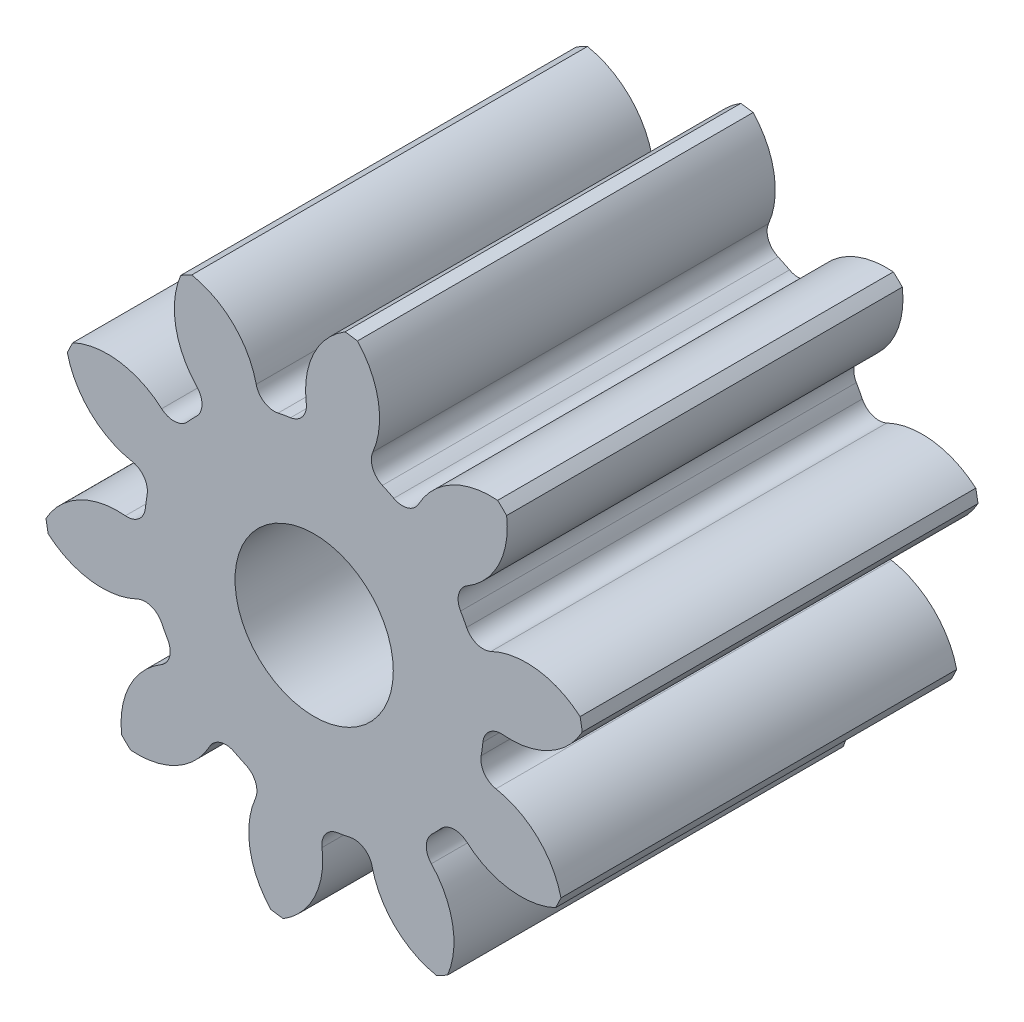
ISO-10303-21;
HEADER;
FILE_DESCRIPTION(('STEP AP214'),'2;1');
FILE_NAME('part.step','',(''),(''),'','','');
FILE_SCHEMA(('AUTOMOTIVE_DESIGN { 1 0 10303 214 1 1 1 1 }'));
ENDSEC;
DATA;
#1=APPLICATION_CONTEXT('core data for automotive mechanical design processes');
#2=APPLICATION_PROTOCOL_DEFINITION('international standard','automotive_design',2000,#1);
#3=PRODUCT_CONTEXT('',#1,'mechanical');
#4=PRODUCT('Part','Part','',(#3));
#5=PRODUCT_RELATED_PRODUCT_CATEGORY('part','',(#4));
#6=PRODUCT_DEFINITION_FORMATION('','',#4);
#7=PRODUCT_DEFINITION_CONTEXT('part definition',#1,'design');
#8=PRODUCT_DEFINITION('design','',#6,#7);
#9=PRODUCT_DEFINITION_SHAPE('','',#8);
#10=(LENGTH_UNIT() NAMED_UNIT(*) SI_UNIT(.MILLI.,.METRE.));
#11=(NAMED_UNIT(*) PLANE_ANGLE_UNIT() SI_UNIT($,.RADIAN.));
#12=(NAMED_UNIT(*) SI_UNIT($,.STERADIAN.) SOLID_ANGLE_UNIT());
#13=UNCERTAINTY_MEASURE_WITH_UNIT(LENGTH_MEASURE(1.E-05),#10,'distance_accuracy_value','');
#14=(GEOMETRIC_REPRESENTATION_CONTEXT(3) GLOBAL_UNCERTAINTY_ASSIGNED_CONTEXT((#13)) GLOBAL_UNIT_ASSIGNED_CONTEXT((#10,
#11,#12)) REPRESENTATION_CONTEXT('',''));
#15=CARTESIAN_POINT('',(0.,0.,0.));
#16=DIRECTION('',(0.,0.,1.));
#17=DIRECTION('',(1.,0.,0.));
#18=AXIS2_PLACEMENT_3D('',#15,#16,#17);
#19=CARTESIAN_POINT('',(0.,0.,88.9));
#20=DIRECTION('',(0.,0.,-1.));
#21=DIRECTION('',(-1.,0.,0.));
#22=AXIS2_PLACEMENT_3D('',#19,#20,#21);
#23=CYLINDRICAL_SURFACE('',#22,60.96);
#24=DIRECTION('',(0.,0.,-1.));
#25=VECTOR('',#24,1.);
#26=CARTESIAN_POINT('',(59.7467694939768,12.1014517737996,44.45));
#27=LINE('',#26,#25);
#28=CARTESIAN_POINT('',(59.7467694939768,12.1014517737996,88.9));
#29=VERTEX_POINT('',#28);
#30=CARTESIAN_POINT('',(59.7467694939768,12.1014517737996,0.));
#31=VERTEX_POINT('',#30);
#32=EDGE_CURVE('E456',#29,#31,#27,.T.);
#33=ORIENTED_EDGE('',*,*,#32,.F.);
#34=CARTESIAN_POINT('',(0.,0.,88.9));
#35=DIRECTION('',(0.,0.,1.));
#36=DIRECTION('',(1.,0.,0.));
#37=AXIS2_PLACEMENT_3D('',#34,#35,#36);
#38=CIRCLE('',#37,60.96);
#39=CARTESIAN_POINT('',(60.2402973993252,9.33960219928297,88.9));
#40=VERTEX_POINT('',#39);
#41=EDGE_CURVE('E797',#40,#29,#38,.T.);
#42=ORIENTED_EDGE('',*,*,#41,.F.);
#43=DIRECTION('',(0.,0.,-1.));
#44=VECTOR('',#43,1.);
#45=CARTESIAN_POINT('',(60.2402973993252,9.33960219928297,44.45));
#46=LINE('',#45,#44);
#47=CARTESIAN_POINT('',(60.2402973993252,9.33960219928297,0.));
#48=VERTEX_POINT('',#47);
#49=EDGE_CURVE('E791',#48,#40,#46,.F.);
#50=ORIENTED_EDGE('',*,*,#49,.F.);
#51=CARTESIAN_POINT('',(0.,0.,0.));
#52=DIRECTION('',(0.,0.,1.));
#53=DIRECTION('',(1.,0.,0.));
#54=AXIS2_PLACEMENT_3D('',#51,#52,#53);
#55=CIRCLE('',#54,60.96);
#56=EDGE_CURVE('E802',#48,#31,#55,.T.);
#57=ORIENTED_EDGE('',*,*,#56,.T.);
#58=EDGE_LOOP('',(#33,#42,#50,#57));
#59=FACE_BOUND('',#58,.T.);
#60=ADVANCED_FACE('F33',(#59),#23,.T.);
#61=DIRECTION('',(0.,0.,-1.));
#62=VECTOR('',#61,1.);
#63=CARTESIAN_POINT('',(43.2457439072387,42.964255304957,44.45));
#64=LINE('',#63,#62);
#65=CARTESIAN_POINT('',(43.2457439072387,42.964255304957,0.));
#66=VERTEX_POINT('',#65);
#67=CARTESIAN_POINT('',(43.2457439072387,42.964255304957,88.9));
#68=VERTEX_POINT('',#67);
#69=EDGE_CURVE('E427',#66,#68,#64,.F.);
#70=ORIENTED_EDGE('',*,*,#69,.F.);
#71=CARTESIAN_POINT('',(41.2230969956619,44.9085501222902,0.));
#72=VERTEX_POINT('',#71);
#73=EDGE_CURVE('E805',#66,#72,#55,.T.);
#74=ORIENTED_EDGE('',*,*,#73,.T.);
#75=DIRECTION('',(0.,0.,-1.));
#76=VECTOR('',#75,1.);
#77=CARTESIAN_POINT('',(41.2230969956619,44.9085501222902,44.45));
#78=LINE('',#77,#76);
#79=CARTESIAN_POINT('',(41.2230969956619,44.9085501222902,88.9));
#80=VERTEX_POINT('',#79);
#81=EDGE_CURVE('E489',#80,#72,#78,.T.);
#82=ORIENTED_EDGE('',*,*,#81,.F.);
#83=EDGE_CURVE('E800',#68,#80,#38,.T.);
#84=ORIENTED_EDGE('',*,*,#83,.F.);
#85=EDGE_LOOP('',(#70,#74,#82,#84));
#86=FACE_BOUND('',#85,.T.);
#87=ADVANCED_FACE('F921',(#86),#23,.T.);
#88=CARTESIAN_POINT('',(0.,0.,88.9));
#89=DIRECTION('',(0.,0.,1.));
#90=DIRECTION('',(1.,0.,0.));
#91=AXIS2_PLACEMENT_3D('',#88,#89,#90);
#92=PLANE('',#91);
#93=CARTESIAN_POINT('',(0.,0.,88.9000000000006));
#94=DIRECTION('',(0.,0.,1.));
#95=DIRECTION('',(1.,0.,0.));
#96=AXIS2_PLACEMENT_3D('',#93,#94,#95);
#97=CIRCLE('',#96,17.78);
#98=CARTESIAN_POINT('',(17.78,0.,88.9000000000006));
#99=VERTEX_POINT('',#98);
#100=EDGE_CURVE('E444',#99,#99,#97,.T.);
#101=ORIENTED_EDGE('',*,*,#100,.F.);
#102=EDGE_LOOP('',(#101));
#103=FACE_BOUND('',#102,.T.);
#104=ORIENTED_EDGE('',*,*,#41,.T.);
#105=CARTESIAN_POINT('',(47.7000071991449,-1.86327106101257,88.9));
#106=DIRECTION('',(0.,0.,-1.));
#107=DIRECTION('',(0.809016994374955,0.587785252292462,0.));
#108=AXIS2_PLACEMENT_3D('',#105,#106,#107);
#109=CIRCLE('',#108,18.4428296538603);
#110=CARTESIAN_POINT('',(39.7472004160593,14.7767658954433,88.9));
#111=VERTEX_POINT('',#110);
#112=EDGE_CURVE('E436',#111,#29,#109,.T.);
#113=ORIENTED_EDGE('',*,*,#112,.F.);
#114=CARTESIAN_POINT('',(37.9640786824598,18.5076765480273,88.9));
#115=DIRECTION('',(0.,0.,1.));
#116=DIRECTION('',(-0.809016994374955,-0.587785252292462,0.));
#117=AXIS2_PLACEMENT_3D('',#114,#115,#116);
#118=CIRCLE('',#117,4.13511999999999);
#119=CARTESIAN_POINT('',(34.2471241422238,16.6956427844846,88.9));
#120=VERTEX_POINT('',#119);
#121=EDGE_CURVE('E434',#120,#111,#118,.T.);
#122=ORIENTED_EDGE('',*,*,#121,.F.);
#123=CARTESIAN_POINT('',(0.,0.,88.9));
#124=DIRECTION('',(0.,0.,-1.));
#125=DIRECTION('',(0.809016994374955,0.587785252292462,0.));
#126=AXIS2_PLACEMENT_3D('',#123,#124,#125);
#127=CIRCLE('',#126,38.1);
#128=CARTESIAN_POINT('',(32.9042340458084,19.2073262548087,88.9));
#129=VERTEX_POINT('',#128);
#130=EDGE_CURVE('E419',#129,#120,#127,.T.);
#131=ORIENTED_EDGE('',*,*,#130,.F.);
#132=CARTESIAN_POINT('',(36.4754402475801,21.2919613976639,88.9));
#133=DIRECTION('',(0.,0.,1.));
#134=DIRECTION('',(-0.809016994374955,-0.587785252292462,0.));
#135=AXIS2_PLACEMENT_3D('',#132,#133,#134);
#136=CIRCLE('',#135,4.13511999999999);
#137=CARTESIAN_POINT('',(34.3631420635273,24.8468754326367,88.9));
#138=VERTEX_POINT('',#137);
#139=EDGE_CURVE('E411',#138,#129,#136,.T.);
#140=ORIENTED_EDGE('',*,*,#139,.F.);
#141=CARTESIAN_POINT('',(24.9421928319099,40.7019591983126,88.9));
#142=DIRECTION('',(0.,0.,-1.));
#143=DIRECTION('',(-0.809016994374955,-0.587785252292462,0.));
#144=AXIS2_PLACEMENT_3D('',#141,#142,#143);
#145=CIRCLE('',#144,18.4428296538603);
#146=EDGE_CURVE('E441',#68,#138,#145,.T.);
#147=ORIENTED_EDGE('',*,*,#146,.F.);
#148=ORIENTED_EDGE('',*,*,#83,.T.);
#149=CARTESIAN_POINT('',(39.685319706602,26.529942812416,88.9));
#150=DIRECTION('',(0.,0.,-1.));
#151=DIRECTION('',(0.309016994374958,0.95105651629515,0.));
#152=AXIS2_PLACEMENT_3D('',#149,#150,#151);
#153=CIRCLE('',#152,18.4428296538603);
#154=CARTESIAN_POINT('',(23.470595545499,35.3174729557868,88.9));
#155=VERTEX_POINT('',#154);
#156=EDGE_CURVE('E465',#155,#80,#153,.T.);
#157=ORIENTED_EDGE('',*,*,#156,.F.);
#158=CARTESIAN_POINT('',(19.8350455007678,37.2877504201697,88.9));
#159=DIRECTION('',(0.,0.,1.));
#160=DIRECTION('',(-0.309016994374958,-0.95105651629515,0.));
#161=AXIS2_PLACEMENT_3D('',#158,#159,#160);
#162=CIRCLE('',#161,4.13511999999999);
#163=CARTESIAN_POINT('',(17.8930528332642,33.6370132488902,88.9));
#164=VERTEX_POINT('',#163);
#165=EDGE_CURVE('E463',#164,#155,#162,.T.);
#166=ORIENTED_EDGE('',*,*,#165,.F.);
#167=CARTESIAN_POINT('',(0.,0.,88.9));
#168=DIRECTION('',(0.,0.,-1.));
#169=DIRECTION('',(0.309016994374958,0.95105651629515,0.));
#170=AXIS2_PLACEMENT_3D('',#167,#168,#169);
#171=CIRCLE('',#170,38.1);
#172=CARTESIAN_POINT('',(15.3303014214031,34.8796768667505,88.9));
#173=VERTEX_POINT('',#172);
#174=EDGE_CURVE('E460',#173,#164,#171,.T.);
#175=ORIENTED_EDGE('',*,*,#174,.F.);
#176=CARTESIAN_POINT('',(16.9941501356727,38.6652844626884,88.9));
#177=DIRECTION('',(0.,0.,1.));
#178=DIRECTION('',(-0.309016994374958,-0.95105651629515,0.));
#179=AXIS2_PLACEMENT_3D('',#176,#177,#178);
#180=CIRCLE('',#179,4.13511999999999);
#181=CARTESIAN_POINT('',(13.1957389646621,40.299692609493,88.9));
#182=VERTEX_POINT('',#181);
#183=EDGE_CURVE('E458',#182,#173,#180,.T.);
#184=ORIENTED_EDGE('',*,*,#183,.F.);
#185=CARTESIAN_POINT('',(-3.74535347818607,47.5892298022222,88.9));
#186=DIRECTION('',(0.,0.,-1.));
#187=DIRECTION('',(-0.309016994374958,-0.95105651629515,0.));
#188=AXIS2_PLACEMENT_3D('',#185,#186,#187);
#189=CIRCLE('',#188,18.4428296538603);
#190=CARTESIAN_POINT('',(9.7327861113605,60.1780231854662,88.9));
#191=VERTEX_POINT('',#190);
#192=EDGE_CURVE('E468',#191,#182,#189,.T.);
#193=ORIENTED_EDGE('',*,*,#192,.F.);
#194=CARTESIAN_POINT('',(6.95360256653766,60.5621087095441,88.9));
#195=VERTEX_POINT('',#194);
#196=EDGE_CURVE('E833',#191,#195,#38,.T.);
#197=ORIENTED_EDGE('',*,*,#196,.T.);
#198=CARTESIAN_POINT('',(16.5121889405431,44.7896202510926,88.9));
#199=DIRECTION('',(0.,0.,-1.));
#200=DIRECTION('',(-0.309016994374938,0.951056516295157,0.));
#201=AXIS2_PLACEMENT_3D('',#198,#199,#200);
#202=CIRCLE('',#201,18.4428296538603);
#203=CARTESIAN_POINT('',(-1.77097908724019,42.3681057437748,88.9));
#204=VERTEX_POINT('',#203);
#205=EDGE_CURVE('E500',#204,#195,#202,.T.);
#206=ORIENTED_EDGE('',*,*,#205,.F.);
#207=CARTESIAN_POINT('',(-5.8703008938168,41.8251709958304,88.9));
#208=DIRECTION('',(0.,0.,1.));
#209=DIRECTION('',(0.309016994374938,-0.951056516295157,0.));
#210=AXIS2_PLACEMENT_3D('',#207,#208,#209);
#211=CIRCLE('',#210,4.13511999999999);
#212=CARTESIAN_POINT('',(-5.29555649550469,37.7301879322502,88.9));
#213=VERTEX_POINT('',#212);
#214=EDGE_CURVE('E498',#213,#204,#211,.T.);
#215=ORIENTED_EDGE('',*,*,#214,.F.);
#216=CARTESIAN_POINT('',(0.,0.,88.9));
#217=DIRECTION('',(0.,0.,-1.));
#218=DIRECTION('',(-0.309016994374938,0.951056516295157,0.));
#219=AXIS2_PLACEMENT_3D('',#216,#217,#218);
#220=CIRCLE('',#219,38.1);
#221=CARTESIAN_POINT('',(-8.09928528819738,37.2291764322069,88.9));
#222=VERTEX_POINT('',#221);
#223=EDGE_CURVE('E495',#222,#213,#220,.T.);
#224=ORIENTED_EDGE('',*,*,#223,.F.);
#225=CARTESIAN_POINT('',(-8.97832771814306,41.2697830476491,88.9));
#226=DIRECTION('',(0.,0.,1.));
#227=DIRECTION('',(0.309016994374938,-0.951056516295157,0.));
#228=AXIS2_PLACEMENT_3D('',#225,#226,#227);
#229=CIRCLE('',#228,4.13511999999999);
#230=CARTESIAN_POINT('',(-13.0119879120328,40.3593969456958,88.9));
#231=VERTEX_POINT('',#230);
#232=EDGE_CURVE('E493',#231,#222,#229,.T.);
#233=ORIENTED_EDGE('',*,*,#232,.F.);
#234=CARTESIAN_POINT('',(-31.0023020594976,36.2990321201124,88.9));
#235=DIRECTION('',(0.,0.,-1.));
#236=DIRECTION('',(0.309016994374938,-0.951056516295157,0.));
#237=AXIS2_PLACEMENT_3D('',#234,#235,#236);
#238=CIRCLE('',#237,18.4428296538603);
#239=CARTESIAN_POINT('',(-27.4977651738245,54.4058315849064,88.9));
#240=VERTEX_POINT('',#239);
#241=EDGE_CURVE('E503',#240,#231,#238,.T.);
#242=ORIENTED_EDGE('',*,*,#241,.F.);
#243=CARTESIAN_POINT('',(-29.9719316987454,53.0830002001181,88.9));
#244=VERTEX_POINT('',#243);
#245=EDGE_CURVE('E903',#240,#244,#38,.T.);
#246=ORIENTED_EDGE('',*,*,#245,.T.);
#247=CARTESIAN_POINT('',(-12.9680367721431,45.9411850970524,88.9));
#248=DIRECTION('',(0.,0.,-1.));
#249=DIRECTION('',(-0.809016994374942,0.58778525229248,0.));
#250=AXIS2_PLACEMENT_3D('',#247,#248,#249);
#251=CIRCLE('',#250,18.4428296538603);
#252=CARTESIAN_POINT('',(-26.3360999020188,33.2355621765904,88.9));
#253=VERTEX_POINT('',#252);
#254=EDGE_CURVE('E538',#253,#244,#251,.T.);
#255=ORIENTED_EDGE('',*,*,#254,.F.);
#256=CARTESIAN_POINT('',(-29.3333918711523,30.3867978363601,88.9));
#257=DIRECTION('',(0.,0.,1.));
#258=DIRECTION('',(0.809016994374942,-0.58778525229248,0.));
#259=AXIS2_PLACEMENT_3D('',#256,#257,#258);
#260=CIRCLE('',#259,4.13511999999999);
#261=CARTESIAN_POINT('',(-26.4614432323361,27.4117132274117,88.9));
#262=VERTEX_POINT('',#261);
#263=EDGE_CURVE('E536',#262,#253,#260,.T.);
#264=ORIENTED_EDGE('',*,*,#263,.F.);
#265=CARTESIAN_POINT('',(0.,0.,88.9));
#266=DIRECTION('',(0.,0.,-1.));
#267=DIRECTION('',(-0.809016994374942,0.58778525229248,0.));
#268=AXIS2_PLACEMENT_3D('',#265,#266,#267);
#269=CIRCLE('',#268,38.1);
#270=CARTESIAN_POINT('',(-28.4352203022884,25.3583959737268,88.9));
#271=VERTEX_POINT('',#270);
#272=EDGE_CURVE('E533',#271,#262,#269,.T.);
#273=ORIENTED_EDGE('',*,*,#272,.F.);
#274=CARTESIAN_POINT('',(-31.5213895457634,28.110627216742,88.9));
#275=DIRECTION('',(0.,0.,1.));
#276=DIRECTION('',(0.809016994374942,-0.58778525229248,0.));
#277=AXIS2_PLACEMENT_3D('',#274,#275,#276);
#278=CIRCLE('',#277,4.13511999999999);
#279=CARTESIAN_POINT('',(-34.2495776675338,25.0031834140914,88.9));
#280=VERTEX_POINT('',#279);
#281=EDGE_CURVE('E531',#280,#271,#278,.T.);
#282=ORIENTED_EDGE('',*,*,#281,.F.);
#283=CARTESIAN_POINT('',(-46.4174249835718,11.1438379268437,88.9));
#284=DIRECTION('',(0.,0.,-1.));
#285=DIRECTION('',(0.809016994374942,-0.58778525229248,0.));
#286=AXIS2_PLACEMENT_3D('',#283,#284,#285);
#287=CIRCLE('',#286,18.4428296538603);
#288=CARTESIAN_POINT('',(-54.2251047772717,27.8524615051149,88.9));
#289=VERTEX_POINT('',#288);
#290=EDGE_CURVE('E541',#289,#280,#287,.T.);
#291=ORIENTED_EDGE('',*,*,#290,.F.);
#292=CARTESIAN_POINT('',(-55.4492067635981,25.3279898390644,88.9));
#293=VERTEX_POINT('',#292);
#294=EDGE_CURVE('E899',#289,#293,#38,.T.);
#295=ORIENTED_EDGE('',*,*,#294,.T.);
#296=CARTESIAN_POINT('',(-37.4949132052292,29.5447787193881,88.9));
#297=DIRECTION('',(0.,0.,-1.));
#298=DIRECTION('',(-1.,0.,0.));
#299=AXIS2_PLACEMENT_3D('',#296,#297,#298);
#300=CIRCLE('',#299,18.4428296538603);
#301=CARTESIAN_POINT('',(-40.841725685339,11.4081634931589,88.9));
#302=VERTEX_POINT('',#301);
#303=EDGE_CURVE('E576',#302,#293,#300,.T.);
#304=ORIENTED_EDGE('',*,*,#303,.F.);
#305=CARTESIAN_POINT('',(-41.5921241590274,7.3417007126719,88.9));
#306=DIRECTION('',(0.,0.,1.));
#307=DIRECTION('',(1.,0.,0.));
#308=AXIS2_PLACEMENT_3D('',#305,#306,#307);
#309=CIRCLE('',#308,4.13511999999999);
#310=CARTESIAN_POINT('',(-37.5199580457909,6.62289575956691,88.9));
#311=VERTEX_POINT('',#310);
#312=EDGE_CURVE('E574',#311,#302,#309,.T.);
#313=ORIENTED_EDGE('',*,*,#312,.F.);
#314=CARTESIAN_POINT('',(0.,0.,88.9));
#315=DIRECTION('',(0.,0.,-1.));
#316=DIRECTION('',(-1.,0.,0.));
#317=AXIS2_PLACEMENT_3D('',#314,#315,#316);
#318=CIRCLE('',#317,38.1);
#319=CARTESIAN_POINT('',(-37.9098676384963,3.80157015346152,88.9));
#320=VERTEX_POINT('',#319);
#321=EDGE_CURVE('E571',#320,#311,#318,.T.);
#322=ORIENTED_EDGE('',*,*,#321,.F.);
#323=CARTESIAN_POINT('',(-42.0243519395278,4.21416723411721,88.9));
#324=DIRECTION('',(0.,0.,1.));
#325=DIRECTION('',(1.,0.,0.));
#326=AXIS2_PLACEMENT_3D('',#323,#324,#325);
#327=CIRCLE('',#326,4.13511999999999);
#328=CARTESIAN_POINT('',(-42.4049928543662,0.096603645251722,88.9));
#329=VERTEX_POINT('',#328);
#330=EDGE_CURVE('E569',#329,#320,#327,.T.);
#331=ORIENTED_EDGE('',*,*,#330,.F.);
#332=CARTESIAN_POINT('',(-44.1026692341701,-18.2679235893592,88.9));
#333=DIRECTION('',(0.,0.,-1.));
#334=DIRECTION('',(1.,0.,0.));
#335=AXIS2_PLACEMENT_3D('',#332,#333,#334);
#336=CIRCLE('',#335,18.4428296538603);
#337=CARTESIAN_POINT('',(-60.2402973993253,-9.33960219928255,88.9));
#338=VERTEX_POINT('',#337);
#339=EDGE_CURVE('E579',#338,#329,#336,.T.);
#340=ORIENTED_EDGE('',*,*,#339,.F.);
#341=CARTESIAN_POINT('',(-59.7467694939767,-12.1014517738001,88.9));
#342=VERTEX_POINT('',#341);
#343=EDGE_CURVE('E895',#338,#342,#38,.T.);
#344=ORIENTED_EDGE('',*,*,#343,.T.);
#345=CARTESIAN_POINT('',(-47.7000071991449,1.86327106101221,88.9));
#346=DIRECTION('',(0.,0.,-1.));
#347=DIRECTION('',(-0.809016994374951,-0.587785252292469,0.));
#348=AXIS2_PLACEMENT_3D('',#345,#346,#347);
#349=CIRCLE('',#348,18.4428296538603);
#350=CARTESIAN_POINT('',(-39.7472004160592,-14.7767658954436,88.9));
#351=VERTEX_POINT('',#350);
#352=EDGE_CURVE('E614',#351,#342,#349,.T.);
#353=ORIENTED_EDGE('',*,*,#352,.F.);
#354=CARTESIAN_POINT('',(-37.9640786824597,-18.5076765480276,88.9));
#355=DIRECTION('',(0.,0.,1.));
#356=DIRECTION('',(0.809016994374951,0.587785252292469,0.));
#357=AXIS2_PLACEMENT_3D('',#354,#355,#356);
#358=CIRCLE('',#357,4.13511999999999);
#359=CARTESIAN_POINT('',(-34.2471241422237,-16.6956427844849,88.9));
#360=VERTEX_POINT('',#359);
#361=EDGE_CURVE('E612',#360,#351,#358,.T.);
#362=ORIENTED_EDGE('',*,*,#361,.F.);
#363=CARTESIAN_POINT('',(0.,0.,88.9));
#364=DIRECTION('',(0.,0.,-1.));
#365=DIRECTION('',(-0.809016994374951,-0.587785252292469,0.));
#366=AXIS2_PLACEMENT_3D('',#363,#364,#365);
#367=CIRCLE('',#366,38.1);
#368=CARTESIAN_POINT('',(-32.9042340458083,-19.2073262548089,88.9));
#369=VERTEX_POINT('',#368);
#370=EDGE_CURVE('E609',#369,#360,#367,.T.);
#371=ORIENTED_EDGE('',*,*,#370,.F.);
#372=CARTESIAN_POINT('',(-36.47544024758,-21.2919613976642,88.9));
#373=DIRECTION('',(0.,0.,1.));
#374=DIRECTION('',(0.809016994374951,0.587785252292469,0.));
#375=AXIS2_PLACEMENT_3D('',#372,#373,#374);
#376=CIRCLE('',#375,4.13511999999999);
#377=CARTESIAN_POINT('',(-34.3631420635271,-24.846875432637,88.9));
#378=VERTEX_POINT('',#377);
#379=EDGE_CURVE('E607',#378,#369,#376,.T.);
#380=ORIENTED_EDGE('',*,*,#379,.F.);
#381=CARTESIAN_POINT('',(-24.9421928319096,-40.7019591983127,88.9));
#382=DIRECTION('',(0.,0.,-1.));
#383=DIRECTION('',(0.809016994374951,0.587785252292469,0.));
#384=AXIS2_PLACEMENT_3D('',#381,#382,#383);
#385=CIRCLE('',#384,18.4428296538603);
#386=CARTESIAN_POINT('',(-43.2457439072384,-42.9642553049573,88.9));
#387=VERTEX_POINT('',#386);
#388=EDGE_CURVE('E617',#387,#378,#385,.T.);
#389=ORIENTED_EDGE('',*,*,#388,.F.);
#390=CARTESIAN_POINT('',(-41.2230969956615,-44.9085501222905,88.9));
#391=VERTEX_POINT('',#390);
#392=EDGE_CURVE('E891',#387,#391,#38,.T.);
#393=ORIENTED_EDGE('',*,*,#392,.T.);
#394=CARTESIAN_POINT('',(-39.6853197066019,-26.5299428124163,88.9));
#395=DIRECTION('',(0.,0.,-1.));
#396=DIRECTION('',(-0.309016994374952,-0.951056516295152,0.));
#397=AXIS2_PLACEMENT_3D('',#394,#395,#396);
#398=CIRCLE('',#397,18.4428296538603);
#399=CARTESIAN_POINT('',(-23.4705955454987,-35.3174729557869,88.9));
#400=VERTEX_POINT('',#399);
#401=EDGE_CURVE('E652',#400,#391,#398,.T.);
#402=ORIENTED_EDGE('',*,*,#401,.F.);
#403=CARTESIAN_POINT('',(-19.8350455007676,-37.2877504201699,88.9));
#404=DIRECTION('',(0.,0.,1.));
#405=DIRECTION('',(0.309016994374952,0.951056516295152,0.));
#406=AXIS2_PLACEMENT_3D('',#403,#404,#405);
#407=CIRCLE('',#406,4.13511999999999);
#408=CARTESIAN_POINT('',(-17.893052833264,-33.6370132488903,88.9));
#409=VERTEX_POINT('',#408);
#410=EDGE_CURVE('E650',#409,#400,#407,.T.);
#411=ORIENTED_EDGE('',*,*,#410,.F.);
#412=CARTESIAN_POINT('',(0.,0.,88.9));
#413=DIRECTION('',(0.,0.,-1.));
#414=DIRECTION('',(-0.309016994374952,-0.951056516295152,0.));
#415=AXIS2_PLACEMENT_3D('',#412,#413,#414);
#416=CIRCLE('',#415,38.1);
#417=CARTESIAN_POINT('',(-15.3303014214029,-34.8796768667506,88.9));
#418=VERTEX_POINT('',#417);
#419=EDGE_CURVE('E647',#418,#409,#416,.T.);
#420=ORIENTED_EDGE('',*,*,#419,.F.);
#421=CARTESIAN_POINT('',(-16.9941501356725,-38.6652844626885,88.9));
#422=DIRECTION('',(0.,0.,1.));
#423=DIRECTION('',(0.309016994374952,0.951056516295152,0.));
#424=AXIS2_PLACEMENT_3D('',#421,#422,#423);
#425=CIRCLE('',#424,4.13511999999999);
#426=CARTESIAN_POINT('',(-13.1957389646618,-40.2996926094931,88.9));
#427=VERTEX_POINT('',#426);
#428=EDGE_CURVE('E645',#427,#418,#425,.T.);
#429=ORIENTED_EDGE('',*,*,#428,.F.);
#430=CARTESIAN_POINT('',(3.7453534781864,-47.5892298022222,88.9));
#431=DIRECTION('',(0.,0.,-1.));
#432=DIRECTION('',(0.309016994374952,0.951056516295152,0.));
#433=AXIS2_PLACEMENT_3D('',#430,#431,#432);
#434=CIRCLE('',#433,18.4428296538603);
#435=CARTESIAN_POINT('',(-9.73278611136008,-60.1780231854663,88.9));
#436=VERTEX_POINT('',#435);
#437=EDGE_CURVE('E655',#436,#427,#434,.T.);
#438=ORIENTED_EDGE('',*,*,#437,.F.);
#439=CARTESIAN_POINT('',(-6.95360256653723,-60.5621087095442,88.9));
#440=VERTEX_POINT('',#439);
#441=EDGE_CURVE('E887',#436,#440,#38,.T.);
#442=ORIENTED_EDGE('',*,*,#441,.T.);
#443=CARTESIAN_POINT('',(-16.5121889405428,-44.7896202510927,88.9));
#444=DIRECTION('',(0.,0.,-1.));
#445=DIRECTION('',(0.309016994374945,-0.951056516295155,0.));
#446=AXIS2_PLACEMENT_3D('',#443,#444,#445);
#447=CIRCLE('',#446,18.4428296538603);
#448=CARTESIAN_POINT('',(1.77097908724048,-42.3681057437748,88.9));
#449=VERTEX_POINT('',#448);
#450=EDGE_CURVE('E690',#449,#440,#447,.T.);
#451=ORIENTED_EDGE('',*,*,#450,.F.);
#452=CARTESIAN_POINT('',(5.87030089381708,-41.8251709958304,88.9));
#453=DIRECTION('',(0.,0.,1.));
#454=DIRECTION('',(-0.309016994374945,0.951056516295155,0.));
#455=AXIS2_PLACEMENT_3D('',#452,#453,#454);
#456=CIRCLE('',#455,4.13511999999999);
#457=CARTESIAN_POINT('',(5.29555649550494,-37.7301879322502,88.9));
#458=VERTEX_POINT('',#457);
#459=EDGE_CURVE('E688',#458,#449,#456,.T.);
#460=ORIENTED_EDGE('',*,*,#459,.F.);
#461=CARTESIAN_POINT('',(0.,0.,88.9));
#462=DIRECTION('',(0.,0.,-1.));
#463=DIRECTION('',(0.309016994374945,-0.951056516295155,0.));
#464=AXIS2_PLACEMENT_3D('',#461,#462,#463);
#465=CIRCLE('',#464,38.1);
#466=CARTESIAN_POINT('',(8.09928528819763,-37.2291764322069,88.9));
#467=VERTEX_POINT('',#466);
#468=EDGE_CURVE('E685',#467,#458,#465,.T.);
#469=ORIENTED_EDGE('',*,*,#468,.F.);
#470=CARTESIAN_POINT('',(8.97832771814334,-41.269783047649,88.9));
#471=DIRECTION('',(0.,0.,1.));
#472=DIRECTION('',(-0.309016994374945,0.951056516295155,0.));
#473=AXIS2_PLACEMENT_3D('',#470,#471,#472);
#474=CIRCLE('',#473,4.13511999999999);
#475=CARTESIAN_POINT('',(13.011987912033,-40.3593969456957,88.9));
#476=VERTEX_POINT('',#475);
#477=EDGE_CURVE('E683',#476,#467,#474,.T.);
#478=ORIENTED_EDGE('',*,*,#477,.F.);
#479=CARTESIAN_POINT('',(31.0023020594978,-36.2990321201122,88.9));
#480=DIRECTION('',(0.,0.,-1.));
#481=DIRECTION('',(-0.309016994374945,0.951056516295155,0.));
#482=AXIS2_PLACEMENT_3D('',#479,#480,#481);
#483=CIRCLE('',#482,18.4428296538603);
#484=CARTESIAN_POINT('',(27.4977651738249,-54.4058315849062,88.9));
#485=VERTEX_POINT('',#484);
#486=EDGE_CURVE('E693',#485,#476,#483,.T.);
#487=ORIENTED_EDGE('',*,*,#486,.F.);
#488=CARTESIAN_POINT('',(29.9719316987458,-53.0830002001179,88.9));
#489=VERTEX_POINT('',#488);
#490=EDGE_CURVE('E886',#485,#489,#38,.T.);
#491=ORIENTED_EDGE('',*,*,#490,.T.);
#492=CARTESIAN_POINT('',(12.9680367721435,-45.9411850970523,88.9));
#493=DIRECTION('',(0.,0.,-1.));
#494=DIRECTION('',(0.809016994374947,-0.587785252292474,0.));
#495=AXIS2_PLACEMENT_3D('',#492,#493,#494);
#496=CIRCLE('',#495,18.4428296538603);
#497=CARTESIAN_POINT('',(26.3360999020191,-33.2355621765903,88.9));
#498=VERTEX_POINT('',#497);
#499=EDGE_CURVE('E728',#498,#489,#496,.T.);
#500=ORIENTED_EDGE('',*,*,#499,.F.);
#501=CARTESIAN_POINT('',(29.3333918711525,-30.3867978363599,88.9));
#502=DIRECTION('',(0.,0.,1.));
#503=DIRECTION('',(-0.809016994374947,0.587785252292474,0.));
#504=AXIS2_PLACEMENT_3D('',#501,#502,#503);
#505=CIRCLE('',#504,4.13511999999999);
#506=CARTESIAN_POINT('',(26.4614432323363,-27.4117132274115,88.9));
#507=VERTEX_POINT('',#506);
#508=EDGE_CURVE('E726',#507,#498,#505,.T.);
#509=ORIENTED_EDGE('',*,*,#508,.F.);
#510=CARTESIAN_POINT('',(0.,0.,88.9));
#511=DIRECTION('',(0.,0.,-1.));
#512=DIRECTION('',(0.809016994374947,-0.587785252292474,0.));
#513=AXIS2_PLACEMENT_3D('',#510,#511,#512);
#514=CIRCLE('',#513,38.1);
#515=CARTESIAN_POINT('',(28.4352203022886,-25.3583959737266,88.9));
#516=VERTEX_POINT('',#515);
#517=EDGE_CURVE('E723',#516,#507,#514,.T.);
#518=ORIENTED_EDGE('',*,*,#517,.F.);
#519=CARTESIAN_POINT('',(31.5213895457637,-28.1106272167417,88.9));
#520=DIRECTION('',(0.,0.,1.));
#521=DIRECTION('',(-0.809016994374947,0.587785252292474,0.));
#522=AXIS2_PLACEMENT_3D('',#519,#520,#521);
#523=CIRCLE('',#522,4.13511999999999);
#524=CARTESIAN_POINT('',(34.249577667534,-25.0031834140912,88.9));
#525=VERTEX_POINT('',#524);
#526=EDGE_CURVE('E721',#525,#516,#523,.T.);
#527=ORIENTED_EDGE('',*,*,#526,.F.);
#528=CARTESIAN_POINT('',(46.4174249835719,-11.1438379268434,88.9));
#529=DIRECTION('',(0.,0.,-1.));
#530=DIRECTION('',(-0.809016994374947,0.587785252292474,0.));
#531=AXIS2_PLACEMENT_3D('',#528,#529,#530);
#532=CIRCLE('',#531,18.4428296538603);
#533=CARTESIAN_POINT('',(54.2251047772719,-27.8524615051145,88.9));
#534=VERTEX_POINT('',#533);
#535=EDGE_CURVE('E731',#534,#525,#532,.T.);
#536=ORIENTED_EDGE('',*,*,#535,.F.);
#537=CARTESIAN_POINT('',(55.4492067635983,-25.327989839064,88.9));
#538=VERTEX_POINT('',#537);
#539=EDGE_CURVE('E801',#534,#538,#38,.T.);
#540=ORIENTED_EDGE('',*,*,#539,.T.);
#541=CARTESIAN_POINT('',(37.4949132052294,-29.5447787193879,88.9));
#542=DIRECTION('',(0.,0.,-1.));
#543=DIRECTION('',(1.,0.,0.));
#544=AXIS2_PLACEMENT_3D('',#541,#542,#543);
#545=CIRCLE('',#544,18.4428296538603);
#546=CARTESIAN_POINT('',(40.8417256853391,-11.4081634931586,88.9));
#547=VERTEX_POINT('',#546);
#548=EDGE_CURVE('E766',#547,#538,#545,.T.);
#549=ORIENTED_EDGE('',*,*,#548,.F.);
#550=CARTESIAN_POINT('',(41.5921241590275,-7.34170071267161,88.9));
#551=DIRECTION('',(0.,0.,1.));
#552=DIRECTION('',(-1.,0.,0.));
#553=AXIS2_PLACEMENT_3D('',#550,#551,#552);
#554=CIRCLE('',#553,4.13511999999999);
#555=CARTESIAN_POINT('',(37.519958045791,-6.62289575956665,88.9));
#556=VERTEX_POINT('',#555);
#557=EDGE_CURVE('E764',#556,#547,#554,.T.);
#558=ORIENTED_EDGE('',*,*,#557,.F.);
#559=CARTESIAN_POINT('',(0.,0.,88.9));
#560=DIRECTION('',(0.,0.,-1.));
#561=DIRECTION('',(1.,0.,0.));
#562=AXIS2_PLACEMENT_3D('',#559,#560,#561);
#563=CIRCLE('',#562,38.1);
#564=CARTESIAN_POINT('',(37.9098676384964,-3.80157015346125,88.9));
#565=VERTEX_POINT('',#564);
#566=EDGE_CURVE('E761',#565,#556,#563,.T.);
#567=ORIENTED_EDGE('',*,*,#566,.F.);
#568=CARTESIAN_POINT('',(42.0243519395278,-4.21416723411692,88.9));
#569=DIRECTION('',(0.,0.,1.));
#570=DIRECTION('',(-1.,0.,0.));
#571=AXIS2_PLACEMENT_3D('',#568,#569,#570);
#572=CIRCLE('',#571,4.13511999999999);
#573=CARTESIAN_POINT('',(42.4049928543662,-0.0966036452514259,88.9));
#574=VERTEX_POINT('',#573);
#575=EDGE_CURVE('E759',#574,#565,#572,.T.);
#576=ORIENTED_EDGE('',*,*,#575,.F.);
#577=CARTESIAN_POINT('',(44.10266923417,18.2679235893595,88.9));
#578=DIRECTION('',(0.,0.,-1.));
#579=DIRECTION('',(-1.,0.,0.));
#580=AXIS2_PLACEMENT_3D('',#577,#578,#579);
#581=CIRCLE('',#580,18.4428296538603);
#582=EDGE_CURVE('E769',#40,#574,#581,.T.);
#583=ORIENTED_EDGE('',*,*,#582,.F.);
#584=EDGE_LOOP('',(#104,#113,#122,#131,#140,#147,#148,#157,#166,#175,#184,#193,#197,#206,#215,
#224,#233,#242,#246,#255,#264,#273,#282,#291,#295,#304,#313,#322,#331,#340,#344,#353,#362,#371,
#380,#389,#393,#402,#411,#420,#429,#438,#442,#451,#460,#469,#478,#487,#491,#500,#509,#518,#527,
#536,#540,#549,#558,#567,#576,#583));
#585=FACE_BOUND('',#584,.T.);
#586=ADVANCED_FACE('F432',(#103,#585),#92,.T.);
#587=CARTESIAN_POINT('',(0.,0.,0.));
#588=DIRECTION('',(0.,0.,1.));
#589=DIRECTION('',(1.,0.,0.));
#590=AXIS2_PLACEMENT_3D('',#587,#588,#589);
#591=PLANE('',#590);
#592=CARTESIAN_POINT('',(0.,0.,0.));
#593=DIRECTION('',(0.,0.,1.));
#594=DIRECTION('',(1.,0.,0.));
#595=AXIS2_PLACEMENT_3D('',#592,#593,#594);
#596=CIRCLE('',#595,17.78);
#597=CARTESIAN_POINT('',(17.78,0.,-1.77635683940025E-12));
#598=VERTEX_POINT('',#597);
#599=EDGE_CURVE('E36',#598,#598,#596,.T.);
#600=ORIENTED_EDGE('',*,*,#599,.T.);
#601=EDGE_LOOP('',(#600));
#602=FACE_BOUND('',#601,.T.);
#603=CARTESIAN_POINT('',(47.7000071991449,-1.86327106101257,0.));
#604=DIRECTION('',(0.,0.,-1.));
#605=DIRECTION('',(0.809016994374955,0.587785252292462,0.));
#606=AXIS2_PLACEMENT_3D('',#603,#604,#605);
#607=CIRCLE('',#606,18.4428296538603);
#608=CARTESIAN_POINT('',(39.7472004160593,14.7767658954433,0.));
#609=VERTEX_POINT('',#608);
#610=EDGE_CURVE('E420',#609,#31,#607,.T.);
#611=ORIENTED_EDGE('',*,*,#610,.T.);
#612=ORIENTED_EDGE('',*,*,#56,.F.);
#613=CARTESIAN_POINT('',(44.10266923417,18.2679235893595,0.));
#614=DIRECTION('',(0.,0.,1.));
#615=DIRECTION('',(1.,0.,0.));
#616=AXIS2_PLACEMENT_3D('',#613,#614,#615);
#617=CIRCLE('',#616,18.4428296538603);
#618=CARTESIAN_POINT('',(42.4049928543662,-0.0966036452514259,0.));
#619=VERTEX_POINT('',#618);
#620=EDGE_CURVE('E799',#619,#48,#617,.T.);
#621=ORIENTED_EDGE('',*,*,#620,.F.);
#622=CARTESIAN_POINT('',(42.0243519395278,-4.21416723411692,0.));
#623=DIRECTION('',(0.,0.,1.));
#624=DIRECTION('',(-1.,0.,0.));
#625=AXIS2_PLACEMENT_3D('',#622,#623,#624);
#626=CIRCLE('',#625,4.13511999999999);
#627=CARTESIAN_POINT('',(37.9098676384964,-3.80157015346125,0.));
#628=VERTEX_POINT('',#627);
#629=EDGE_CURVE('E758',#619,#628,#626,.T.);
#630=ORIENTED_EDGE('',*,*,#629,.T.);
#631=CARTESIAN_POINT('',(0.,0.,0.));
#632=DIRECTION('',(0.,0.,-1.));
#633=DIRECTION('',(1.,0.,0.));
#634=AXIS2_PLACEMENT_3D('',#631,#632,#633);
#635=CIRCLE('',#634,38.1);
#636=CARTESIAN_POINT('',(37.519958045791,-6.62289575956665,0.));
#637=VERTEX_POINT('',#636);
#638=EDGE_CURVE('E774',#628,#637,#635,.T.);
#639=ORIENTED_EDGE('',*,*,#638,.T.);
#640=CARTESIAN_POINT('',(41.5921241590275,-7.34170071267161,0.));
#641=DIRECTION('',(0.,0.,1.));
#642=DIRECTION('',(-1.,0.,0.));
#643=AXIS2_PLACEMENT_3D('',#640,#641,#642);
#644=CIRCLE('',#643,4.13511999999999);
#645=CARTESIAN_POINT('',(40.8417256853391,-11.4081634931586,0.));
#646=VERTEX_POINT('',#645);
#647=EDGE_CURVE('E777',#637,#646,#644,.T.);
#648=ORIENTED_EDGE('',*,*,#647,.T.);
#649=CARTESIAN_POINT('',(37.4949132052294,-29.5447787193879,0.));
#650=DIRECTION('',(0.,0.,-1.));
#651=DIRECTION('',(1.,0.,0.));
#652=AXIS2_PLACEMENT_3D('',#649,#650,#651);
#653=CIRCLE('',#652,18.4428296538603);
#654=CARTESIAN_POINT('',(55.4492067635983,-25.327989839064,0.));
#655=VERTEX_POINT('',#654);
#656=EDGE_CURVE('E762',#646,#655,#653,.T.);
#657=ORIENTED_EDGE('',*,*,#656,.T.);
#658=CARTESIAN_POINT('',(54.2251047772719,-27.8524615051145,0.));
#659=VERTEX_POINT('',#658);
#660=EDGE_CURVE('E796',#659,#655,#55,.T.);
#661=ORIENTED_EDGE('',*,*,#660,.F.);
#662=CARTESIAN_POINT('',(46.4174249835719,-11.1438379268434,0.));
#663=DIRECTION('',(0.,0.,1.));
#664=DIRECTION('',(1.,0.,0.));
#665=AXIS2_PLACEMENT_3D('',#662,#663,#664);
#666=CIRCLE('',#665,18.4428296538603);
#667=CARTESIAN_POINT('',(34.249577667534,-25.0031834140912,0.));
#668=VERTEX_POINT('',#667);
#669=EDGE_CURVE('E807',#668,#659,#666,.T.);
#670=ORIENTED_EDGE('',*,*,#669,.F.);
#671=CARTESIAN_POINT('',(31.5213895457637,-28.1106272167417,0.));
#672=DIRECTION('',(0.,0.,1.));
#673=DIRECTION('',(-0.809016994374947,0.587785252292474,0.));
#674=AXIS2_PLACEMENT_3D('',#671,#672,#673);
#675=CIRCLE('',#674,4.13511999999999);
#676=CARTESIAN_POINT('',(28.4352203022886,-25.3583959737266,0.));
#677=VERTEX_POINT('',#676);
#678=EDGE_CURVE('E720',#668,#677,#675,.T.);
#679=ORIENTED_EDGE('',*,*,#678,.T.);
#680=CARTESIAN_POINT('',(0.,0.,0.));
#681=DIRECTION('',(0.,0.,-1.));
#682=DIRECTION('',(0.809016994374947,-0.587785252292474,0.));
#683=AXIS2_PLACEMENT_3D('',#680,#681,#682);
#684=CIRCLE('',#683,38.1);
#685=CARTESIAN_POINT('',(26.4614432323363,-27.4117132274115,0.));
#686=VERTEX_POINT('',#685);
#687=EDGE_CURVE('E736',#677,#686,#684,.T.);
#688=ORIENTED_EDGE('',*,*,#687,.T.);
#689=CARTESIAN_POINT('',(29.3333918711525,-30.3867978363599,0.));
#690=DIRECTION('',(0.,0.,1.));
#691=DIRECTION('',(-0.809016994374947,0.587785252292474,0.));
#692=AXIS2_PLACEMENT_3D('',#689,#690,#691);
#693=CIRCLE('',#692,4.13511999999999);
#694=CARTESIAN_POINT('',(26.3360999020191,-33.2355621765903,0.));
#695=VERTEX_POINT('',#694);
#696=EDGE_CURVE('E739',#686,#695,#693,.T.);
#697=ORIENTED_EDGE('',*,*,#696,.T.);
#698=CARTESIAN_POINT('',(12.9680367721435,-45.9411850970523,0.));
#699=DIRECTION('',(0.,0.,-1.));
#700=DIRECTION('',(0.809016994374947,-0.587785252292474,0.));
#701=AXIS2_PLACEMENT_3D('',#698,#699,#700);
#702=CIRCLE('',#701,18.4428296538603);
#703=CARTESIAN_POINT('',(29.9719316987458,-53.0830002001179,0.));
#704=VERTEX_POINT('',#703);
#705=EDGE_CURVE('E724',#695,#704,#702,.T.);
#706=ORIENTED_EDGE('',*,*,#705,.T.);
#707=CARTESIAN_POINT('',(27.4977651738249,-54.4058315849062,0.));
#708=VERTEX_POINT('',#707);
#709=EDGE_CURVE('E857',#708,#704,#55,.T.);
#710=ORIENTED_EDGE('',*,*,#709,.F.);
#711=CARTESIAN_POINT('',(31.0023020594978,-36.2990321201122,0.));
#712=DIRECTION('',(0.,0.,1.));
#713=DIRECTION('',(1.,0.,0.));
#714=AXIS2_PLACEMENT_3D('',#711,#712,#713);
#715=CIRCLE('',#714,18.4428296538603);
#716=CARTESIAN_POINT('',(13.011987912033,-40.3593969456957,0.));
#717=VERTEX_POINT('',#716);
#718=EDGE_CURVE('E809',#717,#708,#715,.T.);
#719=ORIENTED_EDGE('',*,*,#718,.F.);
#720=CARTESIAN_POINT('',(8.97832771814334,-41.269783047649,0.));
#721=DIRECTION('',(0.,0.,1.));
#722=DIRECTION('',(-0.309016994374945,0.951056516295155,0.));
#723=AXIS2_PLACEMENT_3D('',#720,#721,#722);
#724=CIRCLE('',#723,4.13511999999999);
#725=CARTESIAN_POINT('',(8.09928528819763,-37.2291764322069,0.));
#726=VERTEX_POINT('',#725);
#727=EDGE_CURVE('E682',#717,#726,#724,.T.);
#728=ORIENTED_EDGE('',*,*,#727,.T.);
#729=CARTESIAN_POINT('',(0.,0.,0.));
#730=DIRECTION('',(0.,0.,-1.));
#731=DIRECTION('',(0.309016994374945,-0.951056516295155,0.));
#732=AXIS2_PLACEMENT_3D('',#729,#730,#731);
#733=CIRCLE('',#732,38.1);
#734=CARTESIAN_POINT('',(5.29555649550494,-37.7301879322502,0.));
#735=VERTEX_POINT('',#734);
#736=EDGE_CURVE('E698',#726,#735,#733,.T.);
#737=ORIENTED_EDGE('',*,*,#736,.T.);
#738=CARTESIAN_POINT('',(5.87030089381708,-41.8251709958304,0.));
#739=DIRECTION('',(0.,0.,1.));
#740=DIRECTION('',(-0.309016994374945,0.951056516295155,0.));
#741=AXIS2_PLACEMENT_3D('',#738,#739,#740);
#742=CIRCLE('',#741,4.13511999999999);
#743=CARTESIAN_POINT('',(1.77097908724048,-42.3681057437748,0.));
#744=VERTEX_POINT('',#743);
#745=EDGE_CURVE('E701',#735,#744,#742,.T.);
#746=ORIENTED_EDGE('',*,*,#745,.T.);
#747=CARTESIAN_POINT('',(-16.5121889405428,-44.7896202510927,0.));
#748=DIRECTION('',(0.,0.,-1.));
#749=DIRECTION('',(0.309016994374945,-0.951056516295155,0.));
#750=AXIS2_PLACEMENT_3D('',#747,#748,#749);
#751=CIRCLE('',#750,18.4428296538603);
#752=CARTESIAN_POINT('',(-6.95360256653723,-60.5621087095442,0.));
#753=VERTEX_POINT('',#752);
#754=EDGE_CURVE('E686',#744,#753,#751,.T.);
#755=ORIENTED_EDGE('',*,*,#754,.T.);
#756=CARTESIAN_POINT('',(-9.73278611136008,-60.1780231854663,0.));
#757=VERTEX_POINT('',#756);
#758=EDGE_CURVE('E852',#757,#753,#55,.T.);
#759=ORIENTED_EDGE('',*,*,#758,.F.);
#760=CARTESIAN_POINT('',(3.7453534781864,-47.5892298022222,0.));
#761=DIRECTION('',(0.,0.,1.));
#762=DIRECTION('',(1.,0.,0.));
#763=AXIS2_PLACEMENT_3D('',#760,#761,#762);
#764=CIRCLE('',#763,18.4428296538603);
#765=CARTESIAN_POINT('',(-13.1957389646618,-40.2996926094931,0.));
#766=VERTEX_POINT('',#765);
#767=EDGE_CURVE('E811',#766,#757,#764,.T.);
#768=ORIENTED_EDGE('',*,*,#767,.F.);
#769=CARTESIAN_POINT('',(-16.9941501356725,-38.6652844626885,0.));
#770=DIRECTION('',(0.,0.,1.));
#771=DIRECTION('',(0.309016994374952,0.951056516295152,0.));
#772=AXIS2_PLACEMENT_3D('',#769,#770,#771);
#773=CIRCLE('',#772,4.13511999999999);
#774=CARTESIAN_POINT('',(-15.3303014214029,-34.8796768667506,0.));
#775=VERTEX_POINT('',#774);
#776=EDGE_CURVE('E644',#766,#775,#773,.T.);
#777=ORIENTED_EDGE('',*,*,#776,.T.);
#778=CARTESIAN_POINT('',(0.,0.,0.));
#779=DIRECTION('',(0.,0.,-1.));
#780=DIRECTION('',(-0.309016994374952,-0.951056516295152,0.));
#781=AXIS2_PLACEMENT_3D('',#778,#779,#780);
#782=CIRCLE('',#781,38.1);
#783=CARTESIAN_POINT('',(-17.893052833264,-33.6370132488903,0.));
#784=VERTEX_POINT('',#783);
#785=EDGE_CURVE('E660',#775,#784,#782,.T.);
#786=ORIENTED_EDGE('',*,*,#785,.T.);
#787=CARTESIAN_POINT('',(-19.8350455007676,-37.2877504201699,0.));
#788=DIRECTION('',(0.,0.,1.));
#789=DIRECTION('',(0.309016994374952,0.951056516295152,0.));
#790=AXIS2_PLACEMENT_3D('',#787,#788,#789);
#791=CIRCLE('',#790,4.13511999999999);
#792=CARTESIAN_POINT('',(-23.4705955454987,-35.3174729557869,0.));
#793=VERTEX_POINT('',#792);
#794=EDGE_CURVE('E663',#784,#793,#791,.T.);
#795=ORIENTED_EDGE('',*,*,#794,.T.);
#796=CARTESIAN_POINT('',(-39.6853197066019,-26.5299428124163,0.));
#797=DIRECTION('',(0.,0.,-1.));
#798=DIRECTION('',(-0.309016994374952,-0.951056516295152,0.));
#799=AXIS2_PLACEMENT_3D('',#796,#797,#798);
#800=CIRCLE('',#799,18.4428296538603);
#801=CARTESIAN_POINT('',(-41.2230969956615,-44.9085501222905,0.));
#802=VERTEX_POINT('',#801);
#803=EDGE_CURVE('E648',#793,#802,#800,.T.);
#804=ORIENTED_EDGE('',*,*,#803,.T.);
#805=CARTESIAN_POINT('',(-43.2457439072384,-42.9642553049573,0.));
#806=VERTEX_POINT('',#805);
#807=EDGE_CURVE('E847',#806,#802,#55,.T.);
#808=ORIENTED_EDGE('',*,*,#807,.F.);
#809=CARTESIAN_POINT('',(-24.9421928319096,-40.7019591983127,0.));
#810=DIRECTION('',(0.,0.,1.));
#811=DIRECTION('',(1.,0.,0.));
#812=AXIS2_PLACEMENT_3D('',#809,#810,#811);
#813=CIRCLE('',#812,18.4428296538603);
#814=CARTESIAN_POINT('',(-34.3631420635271,-24.846875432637,0.));
#815=VERTEX_POINT('',#814);
#816=EDGE_CURVE('E813',#815,#806,#813,.T.);
#817=ORIENTED_EDGE('',*,*,#816,.F.);
#818=CARTESIAN_POINT('',(-36.47544024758,-21.2919613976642,0.));
#819=DIRECTION('',(0.,0.,1.));
#820=DIRECTION('',(0.809016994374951,0.587785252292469,0.));
#821=AXIS2_PLACEMENT_3D('',#818,#819,#820);
#822=CIRCLE('',#821,4.13511999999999);
#823=CARTESIAN_POINT('',(-32.9042340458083,-19.2073262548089,0.));
#824=VERTEX_POINT('',#823);
#825=EDGE_CURVE('E606',#815,#824,#822,.T.);
#826=ORIENTED_EDGE('',*,*,#825,.T.);
#827=CARTESIAN_POINT('',(0.,0.,0.));
#828=DIRECTION('',(0.,0.,-1.));
#829=DIRECTION('',(-0.809016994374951,-0.587785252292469,0.));
#830=AXIS2_PLACEMENT_3D('',#827,#828,#829);
#831=CIRCLE('',#830,38.1);
#832=CARTESIAN_POINT('',(-34.2471241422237,-16.6956427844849,0.));
#833=VERTEX_POINT('',#832);
#834=EDGE_CURVE('E622',#824,#833,#831,.T.);
#835=ORIENTED_EDGE('',*,*,#834,.T.);
#836=CARTESIAN_POINT('',(-37.9640786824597,-18.5076765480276,0.));
#837=DIRECTION('',(0.,0.,1.));
#838=DIRECTION('',(0.809016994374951,0.587785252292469,0.));
#839=AXIS2_PLACEMENT_3D('',#836,#837,#838);
#840=CIRCLE('',#839,4.13511999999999);
#841=CARTESIAN_POINT('',(-39.7472004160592,-14.7767658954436,0.));
#842=VERTEX_POINT('',#841);
#843=EDGE_CURVE('E625',#833,#842,#840,.T.);
#844=ORIENTED_EDGE('',*,*,#843,.T.);
#845=CARTESIAN_POINT('',(-47.7000071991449,1.86327106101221,0.));
#846=DIRECTION('',(0.,0.,-1.));
#847=DIRECTION('',(-0.809016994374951,-0.587785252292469,0.));
#848=AXIS2_PLACEMENT_3D('',#845,#846,#847);
#849=CIRCLE('',#848,18.4428296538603);
#850=CARTESIAN_POINT('',(-59.7467694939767,-12.1014517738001,0.));
#851=VERTEX_POINT('',#850);
#852=EDGE_CURVE('E610',#842,#851,#849,.T.);
#853=ORIENTED_EDGE('',*,*,#852,.T.);
#854=CARTESIAN_POINT('',(-60.2402973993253,-9.33960219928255,0.));
#855=VERTEX_POINT('',#854);
#856=EDGE_CURVE('E842',#855,#851,#55,.T.);
#857=ORIENTED_EDGE('',*,*,#856,.F.);
#858=CARTESIAN_POINT('',(-44.1026692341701,-18.2679235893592,0.));
#859=DIRECTION('',(0.,0.,1.));
#860=DIRECTION('',(1.,0.,0.));
#861=AXIS2_PLACEMENT_3D('',#858,#859,#860);
#862=CIRCLE('',#861,18.4428296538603);
#863=CARTESIAN_POINT('',(-42.4049928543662,0.0966036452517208,0.));
#864=VERTEX_POINT('',#863);
#865=EDGE_CURVE('E815',#864,#855,#862,.T.);
#866=ORIENTED_EDGE('',*,*,#865,.F.);
#867=CARTESIAN_POINT('',(-42.0243519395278,4.21416723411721,0.));
#868=DIRECTION('',(0.,0.,1.));
#869=DIRECTION('',(1.,0.,0.));
#870=AXIS2_PLACEMENT_3D('',#867,#868,#869);
#871=CIRCLE('',#870,4.13511999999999);
#872=CARTESIAN_POINT('',(-37.9098676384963,3.80157015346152,0.));
#873=VERTEX_POINT('',#872);
#874=EDGE_CURVE('E568',#864,#873,#871,.T.);
#875=ORIENTED_EDGE('',*,*,#874,.T.);
#876=CARTESIAN_POINT('',(0.,0.,0.));
#877=DIRECTION('',(0.,0.,-1.));
#878=DIRECTION('',(-1.,0.,0.));
#879=AXIS2_PLACEMENT_3D('',#876,#877,#878);
#880=CIRCLE('',#879,38.1);
#881=CARTESIAN_POINT('',(-37.5199580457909,6.62289575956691,0.));
#882=VERTEX_POINT('',#881);
#883=EDGE_CURVE('E584',#873,#882,#880,.T.);
#884=ORIENTED_EDGE('',*,*,#883,.T.);
#885=CARTESIAN_POINT('',(-41.5921241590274,7.3417007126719,0.));
#886=DIRECTION('',(0.,0.,1.));
#887=DIRECTION('',(1.,0.,0.));
#888=AXIS2_PLACEMENT_3D('',#885,#886,#887);
#889=CIRCLE('',#888,4.13511999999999);
#890=CARTESIAN_POINT('',(-40.841725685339,11.4081634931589,0.));
#891=VERTEX_POINT('',#890);
#892=EDGE_CURVE('E587',#882,#891,#889,.T.);
#893=ORIENTED_EDGE('',*,*,#892,.T.);
#894=CARTESIAN_POINT('',(-37.4949132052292,29.5447787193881,0.));
#895=DIRECTION('',(0.,0.,-1.));
#896=DIRECTION('',(-1.,0.,0.));
#897=AXIS2_PLACEMENT_3D('',#894,#895,#896);
#898=CIRCLE('',#897,18.4428296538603);
#899=CARTESIAN_POINT('',(-55.4492067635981,25.3279898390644,0.));
#900=VERTEX_POINT('',#899);
#901=EDGE_CURVE('E572',#891,#900,#898,.T.);
#902=ORIENTED_EDGE('',*,*,#901,.T.);
#903=CARTESIAN_POINT('',(-54.2251047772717,27.8524615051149,0.));
#904=VERTEX_POINT('',#903);
#905=EDGE_CURVE('E837',#904,#900,#55,.T.);
#906=ORIENTED_EDGE('',*,*,#905,.F.);
#907=CARTESIAN_POINT('',(-46.4174249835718,11.1438379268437,0.));
#908=DIRECTION('',(0.,0.,1.));
#909=DIRECTION('',(1.,0.,0.));
#910=AXIS2_PLACEMENT_3D('',#907,#908,#909);
#911=CIRCLE('',#910,18.4428296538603);
#912=CARTESIAN_POINT('',(-34.2495776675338,25.0031834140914,0.));
#913=VERTEX_POINT('',#912);
#914=EDGE_CURVE('E817',#913,#904,#911,.T.);
#915=ORIENTED_EDGE('',*,*,#914,.F.);
#916=CARTESIAN_POINT('',(-31.5213895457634,28.110627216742,0.));
#917=DIRECTION('',(0.,0.,1.));
#918=DIRECTION('',(0.809016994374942,-0.58778525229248,0.));
#919=AXIS2_PLACEMENT_3D('',#916,#917,#918);
#920=CIRCLE('',#919,4.13511999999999);
#921=CARTESIAN_POINT('',(-28.4352203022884,25.3583959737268,0.));
#922=VERTEX_POINT('',#921);
#923=EDGE_CURVE('E530',#913,#922,#920,.T.);
#924=ORIENTED_EDGE('',*,*,#923,.T.);
#925=CARTESIAN_POINT('',(0.,0.,0.));
#926=DIRECTION('',(0.,0.,-1.));
#927=DIRECTION('',(-0.809016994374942,0.58778525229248,0.));
#928=AXIS2_PLACEMENT_3D('',#925,#926,#927);
#929=CIRCLE('',#928,38.1);
#930=CARTESIAN_POINT('',(-26.4614432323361,27.4117132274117,0.));
#931=VERTEX_POINT('',#930);
#932=EDGE_CURVE('E546',#922,#931,#929,.T.);
#933=ORIENTED_EDGE('',*,*,#932,.T.);
#934=CARTESIAN_POINT('',(-29.3333918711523,30.3867978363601,0.));
#935=DIRECTION('',(0.,0.,1.));
#936=DIRECTION('',(0.809016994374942,-0.58778525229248,0.));
#937=AXIS2_PLACEMENT_3D('',#934,#935,#936);
#938=CIRCLE('',#937,4.13511999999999);
#939=CARTESIAN_POINT('',(-26.3360999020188,33.2355621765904,0.));
#940=VERTEX_POINT('',#939);
#941=EDGE_CURVE('E549',#931,#940,#938,.T.);
#942=ORIENTED_EDGE('',*,*,#941,.T.);
#943=CARTESIAN_POINT('',(-12.9680367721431,45.9411850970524,0.));
#944=DIRECTION('',(0.,0.,-1.));
#945=DIRECTION('',(-0.809016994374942,0.58778525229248,0.));
#946=AXIS2_PLACEMENT_3D('',#943,#944,#945);
#947=CIRCLE('',#946,18.4428296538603);
#948=CARTESIAN_POINT('',(-29.9719316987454,53.0830002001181,0.));
#949=VERTEX_POINT('',#948);
#950=EDGE_CURVE('E534',#940,#949,#947,.T.);
#951=ORIENTED_EDGE('',*,*,#950,.T.);
#952=CARTESIAN_POINT('',(-27.4977651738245,54.4058315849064,0.));
#953=VERTEX_POINT('',#952);
#954=EDGE_CURVE('E836',#953,#949,#55,.T.);
#955=ORIENTED_EDGE('',*,*,#954,.F.);
#956=CARTESIAN_POINT('',(-31.0023020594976,36.2990321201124,0.));
#957=DIRECTION('',(0.,0.,1.));
#958=DIRECTION('',(1.,0.,0.));
#959=AXIS2_PLACEMENT_3D('',#956,#957,#958);
#960=CIRCLE('',#959,18.4428296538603);
#961=CARTESIAN_POINT('',(-13.0119879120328,40.3593969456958,0.));
#962=VERTEX_POINT('',#961);
#963=EDGE_CURVE('E819',#962,#953,#960,.T.);
#964=ORIENTED_EDGE('',*,*,#963,.F.);
#965=CARTESIAN_POINT('',(-8.97832771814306,41.2697830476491,0.));
#966=DIRECTION('',(0.,0.,1.));
#967=DIRECTION('',(0.309016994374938,-0.951056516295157,0.));
#968=AXIS2_PLACEMENT_3D('',#965,#966,#967);
#969=CIRCLE('',#968,4.13511999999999);
#970=CARTESIAN_POINT('',(-8.09928528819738,37.2291764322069,0.));
#971=VERTEX_POINT('',#970);
#972=EDGE_CURVE('E492',#962,#971,#969,.T.);
#973=ORIENTED_EDGE('',*,*,#972,.T.);
#974=CARTESIAN_POINT('',(0.,0.,0.));
#975=DIRECTION('',(0.,0.,-1.));
#976=DIRECTION('',(-0.309016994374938,0.951056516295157,0.));
#977=AXIS2_PLACEMENT_3D('',#974,#975,#976);
#978=CIRCLE('',#977,38.1);
#979=CARTESIAN_POINT('',(-5.29555649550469,37.7301879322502,0.));
#980=VERTEX_POINT('',#979);
#981=EDGE_CURVE('E508',#971,#980,#978,.T.);
#982=ORIENTED_EDGE('',*,*,#981,.T.);
#983=CARTESIAN_POINT('',(-5.8703008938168,41.8251709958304,0.));
#984=DIRECTION('',(0.,0.,1.));
#985=DIRECTION('',(0.309016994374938,-0.951056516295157,0.));
#986=AXIS2_PLACEMENT_3D('',#983,#984,#985);
#987=CIRCLE('',#986,4.13511999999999);
#988=CARTESIAN_POINT('',(-1.77097908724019,42.3681057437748,0.));
#989=VERTEX_POINT('',#988);
#990=EDGE_CURVE('E511',#980,#989,#987,.T.);
#991=ORIENTED_EDGE('',*,*,#990,.T.);
#992=CARTESIAN_POINT('',(16.5121889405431,44.7896202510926,0.));
#993=DIRECTION('',(0.,0.,-1.));
#994=DIRECTION('',(-0.309016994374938,0.951056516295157,0.));
#995=AXIS2_PLACEMENT_3D('',#992,#993,#994);
#996=CIRCLE('',#995,18.4428296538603);
#997=CARTESIAN_POINT('',(6.95360256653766,60.5621087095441,0.));
#998=VERTEX_POINT('',#997);
#999=EDGE_CURVE('E496',#989,#998,#996,.T.);
#1000=ORIENTED_EDGE('',*,*,#999,.T.);
#1001=CARTESIAN_POINT('',(9.7327861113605,60.1780231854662,0.));
#1002=VERTEX_POINT('',#1001);
#1003=EDGE_CURVE('E832',#1002,#998,#55,.T.);
#1004=ORIENTED_EDGE('',*,*,#1003,.F.);
#1005=CARTESIAN_POINT('',(-3.74535347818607,47.5892298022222,0.));
#1006=DIRECTION('',(0.,0.,1.));
#1007=DIRECTION('',(1.,0.,0.));
#1008=AXIS2_PLACEMENT_3D('',#1005,#1006,#1007);
#1009=CIRCLE('',#1008,18.4428296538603);
#1010=CARTESIAN_POINT('',(13.1957389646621,40.299692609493,0.));
#1011=VERTEX_POINT('',#1010);
#1012=EDGE_CURVE('E41',#1011,#1002,#1009,.T.);
#1013=ORIENTED_EDGE('',*,*,#1012,.F.);
#1014=CARTESIAN_POINT('',(16.9941501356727,38.6652844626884,0.));
#1015=DIRECTION('',(0.,0.,1.));
#1016=DIRECTION('',(-0.309016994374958,-0.95105651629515,0.));
#1017=AXIS2_PLACEMENT_3D('',#1014,#1015,#1016);
#1018=CIRCLE('',#1017,4.13511999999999);
#1019=CARTESIAN_POINT('',(15.3303014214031,34.8796768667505,0.));
#1020=VERTEX_POINT('',#1019);
#1021=EDGE_CURVE('E56',#1011,#1020,#1018,.T.);
#1022=ORIENTED_EDGE('',*,*,#1021,.T.);
#1023=CARTESIAN_POINT('',(0.,0.,0.));
#1024=DIRECTION('',(0.,0.,-1.));
#1025=DIRECTION('',(0.309016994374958,0.95105651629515,0.));
#1026=AXIS2_PLACEMENT_3D('',#1023,#1024,#1025);
#1027=CIRCLE('',#1026,38.1);
#1028=CARTESIAN_POINT('',(17.8930528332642,33.6370132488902,0.));
#1029=VERTEX_POINT('',#1028);
#1030=EDGE_CURVE('E472',#1020,#1029,#1027,.T.);
#1031=ORIENTED_EDGE('',*,*,#1030,.T.);
#1032=CARTESIAN_POINT('',(19.8350455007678,37.2877504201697,0.));
#1033=DIRECTION('',(0.,0.,1.));
#1034=DIRECTION('',(-0.309016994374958,-0.95105651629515,0.));
#1035=AXIS2_PLACEMENT_3D('',#1032,#1033,#1034);
#1036=CIRCLE('',#1035,4.13511999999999);
#1037=CARTESIAN_POINT('',(23.470595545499,35.3174729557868,0.));
#1038=VERTEX_POINT('',#1037);
#1039=EDGE_CURVE('E475',#1029,#1038,#1036,.T.);
#1040=ORIENTED_EDGE('',*,*,#1039,.T.);
#1041=CARTESIAN_POINT('',(39.685319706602,26.529942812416,0.));
#1042=DIRECTION('',(0.,0.,-1.));
#1043=DIRECTION('',(0.309016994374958,0.95105651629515,0.));
#1044=AXIS2_PLACEMENT_3D('',#1041,#1042,#1043);
#1045=CIRCLE('',#1044,18.4428296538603);
#1046=EDGE_CURVE('E461',#1038,#72,#1045,.T.);
#1047=ORIENTED_EDGE('',*,*,#1046,.T.);
#1048=ORIENTED_EDGE('',*,*,#73,.F.);
#1049=CARTESIAN_POINT('',(24.9421928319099,40.7019591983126,0.));
#1050=DIRECTION('',(0.,0.,1.));
#1051=DIRECTION('',(1.,0.,0.));
#1052=AXIS2_PLACEMENT_3D('',#1049,#1050,#1051);
#1053=CIRCLE('',#1052,18.4428296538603);
#1054=CARTESIAN_POINT('',(34.3631420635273,24.8468754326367,0.));
#1055=VERTEX_POINT('',#1054);
#1056=EDGE_CURVE('E11',#1055,#66,#1053,.T.);
#1057=ORIENTED_EDGE('',*,*,#1056,.F.);
#1058=CARTESIAN_POINT('',(36.4754402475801,21.2919613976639,0.));
#1059=DIRECTION('',(0.,0.,1.));
#1060=DIRECTION('',(-0.809016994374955,-0.587785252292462,0.));
#1061=AXIS2_PLACEMENT_3D('',#1058,#1059,#1060);
#1062=CIRCLE('',#1061,4.13511999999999);
#1063=CARTESIAN_POINT('',(32.9042340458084,19.2073262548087,0.));
#1064=VERTEX_POINT('',#1063);
#1065=EDGE_CURVE('E48',#1055,#1064,#1062,.T.);
#1066=ORIENTED_EDGE('',*,*,#1065,.T.);
#1067=CARTESIAN_POINT('',(0.,0.,0.));
#1068=DIRECTION('',(0.,0.,-1.));
#1069=DIRECTION('',(0.809016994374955,0.587785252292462,0.));
#1070=AXIS2_PLACEMENT_3D('',#1067,#1068,#1069);
#1071=CIRCLE('',#1070,38.1);
#1072=CARTESIAN_POINT('',(34.2471241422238,16.6956427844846,0.));
#1073=VERTEX_POINT('',#1072);
#1074=EDGE_CURVE('E426',#1064,#1073,#1071,.T.);
#1075=ORIENTED_EDGE('',*,*,#1074,.T.);
#1076=CARTESIAN_POINT('',(37.9640786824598,18.5076765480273,0.));
#1077=DIRECTION('',(0.,0.,1.));
#1078=DIRECTION('',(-0.809016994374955,-0.587785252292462,0.));
#1079=AXIS2_PLACEMENT_3D('',#1076,#1077,#1078);
#1080=CIRCLE('',#1079,4.13511999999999);
#1081=EDGE_CURVE('E446',#1073,#609,#1080,.T.);
#1082=ORIENTED_EDGE('',*,*,#1081,.T.);
#1083=EDGE_LOOP('',(#611,#612,#621,#630,#639,#648,#657,#661,#670,#679,#688,#697,#706,#710,#719,
#728,#737,#746,#755,#759,#768,#777,#786,#795,#804,#808,#817,#826,#835,#844,#853,#857,#866,#875,
#884,#893,#902,#906,#915,#924,#933,#942,#951,#955,#964,#973,#982,#991,#1000,#1004,#1013,#1022,
#1031,#1040,#1047,#1048,#1057,#1066,#1075,#1082));
#1084=FACE_BOUND('',#1083,.T.);
#1085=ADVANCED_FACE('F834',(#602,#1084),#591,.F.);
#1086=DIRECTION('',(0.,0.,-1.));
#1087=VECTOR('',#1086,1.);
#1088=CARTESIAN_POINT('',(9.7327861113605,60.1780231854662,44.45));
#1089=LINE('',#1088,#1087);
#1090=EDGE_CURVE('E487',#1002,#191,#1089,.F.);
#1091=ORIENTED_EDGE('',*,*,#1090,.F.);
#1092=ORIENTED_EDGE('',*,*,#1003,.T.);
#1093=DIRECTION('',(0.,0.,-1.));
#1094=VECTOR('',#1093,1.);
#1095=CARTESIAN_POINT('',(6.95360256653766,60.5621087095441,44.45));
#1096=LINE('',#1095,#1094);
#1097=EDGE_CURVE('E527',#195,#998,#1096,.T.);
#1098=ORIENTED_EDGE('',*,*,#1097,.F.);
#1099=ORIENTED_EDGE('',*,*,#196,.F.);
#1100=EDGE_LOOP('',(#1091,#1092,#1098,#1099));
#1101=FACE_BOUND('',#1100,.T.);
#1102=ADVANCED_FACE('F830',(#1101),#23,.T.);
#1103=DIRECTION('',(0.,0.,-1.));
#1104=VECTOR('',#1103,1.);
#1105=CARTESIAN_POINT('',(-27.4977651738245,54.4058315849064,44.45));
#1106=LINE('',#1105,#1104);
#1107=EDGE_CURVE('E525',#953,#240,#1106,.F.);
#1108=ORIENTED_EDGE('',*,*,#1107,.F.);
#1109=ORIENTED_EDGE('',*,*,#954,.T.);
#1110=DIRECTION('',(0.,0.,-1.));
#1111=VECTOR('',#1110,1.);
#1112=CARTESIAN_POINT('',(-29.9719316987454,53.0830002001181,44.45));
#1113=LINE('',#1112,#1111);
#1114=EDGE_CURVE('E565',#244,#949,#1113,.T.);
#1115=ORIENTED_EDGE('',*,*,#1114,.F.);
#1116=ORIENTED_EDGE('',*,*,#245,.F.);
#1117=EDGE_LOOP('',(#1108,#1109,#1115,#1116));
#1118=FACE_BOUND('',#1117,.T.);
#1119=ADVANCED_FACE('F1019',(#1118),#23,.T.);
#1120=DIRECTION('',(0.,0.,-1.));
#1121=VECTOR('',#1120,1.);
#1122=CARTESIAN_POINT('',(-54.2251047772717,27.8524615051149,44.45));
#1123=LINE('',#1122,#1121);
#1124=EDGE_CURVE('E563',#904,#289,#1123,.F.);
#1125=ORIENTED_EDGE('',*,*,#1124,.F.);
#1126=ORIENTED_EDGE('',*,*,#905,.T.);
#1127=DIRECTION('',(0.,0.,-1.));
#1128=VECTOR('',#1127,1.);
#1129=CARTESIAN_POINT('',(-55.4492067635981,25.3279898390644,44.45));
#1130=LINE('',#1129,#1128);
#1131=EDGE_CURVE('E603',#293,#900,#1130,.T.);
#1132=ORIENTED_EDGE('',*,*,#1131,.F.);
#1133=ORIENTED_EDGE('',*,*,#294,.F.);
#1134=EDGE_LOOP('',(#1125,#1126,#1132,#1133));
#1135=FACE_BOUND('',#1134,.T.);
#1136=ADVANCED_FACE('F1107',(#1135),#23,.T.);
#1137=DIRECTION('',(0.,0.,-1.));
#1138=VECTOR('',#1137,1.);
#1139=CARTESIAN_POINT('',(-60.2402973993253,-9.33960219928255,44.45));
#1140=LINE('',#1139,#1138);
#1141=EDGE_CURVE('E601',#855,#338,#1140,.F.);
#1142=ORIENTED_EDGE('',*,*,#1141,.F.);
#1143=ORIENTED_EDGE('',*,*,#856,.T.);
#1144=DIRECTION('',(0.,0.,-1.));
#1145=VECTOR('',#1144,1.);
#1146=CARTESIAN_POINT('',(-59.7467694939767,-12.1014517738,44.45));
#1147=LINE('',#1146,#1145);
#1148=EDGE_CURVE('E641',#342,#851,#1147,.T.);
#1149=ORIENTED_EDGE('',*,*,#1148,.F.);
#1150=ORIENTED_EDGE('',*,*,#343,.F.);
#1151=EDGE_LOOP('',(#1142,#1143,#1149,#1150));
#1152=FACE_BOUND('',#1151,.T.);
#1153=ADVANCED_FACE('F1114',(#1152),#23,.T.);
#1154=DIRECTION('',(0.,0.,-1.));
#1155=VECTOR('',#1154,1.);
#1156=CARTESIAN_POINT('',(-43.2457439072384,-42.9642553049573,44.45));
#1157=LINE('',#1156,#1155);
#1158=EDGE_CURVE('E639',#806,#387,#1157,.F.);
#1159=ORIENTED_EDGE('',*,*,#1158,.F.);
#1160=ORIENTED_EDGE('',*,*,#807,.T.);
#1161=DIRECTION('',(0.,0.,-1.));
#1162=VECTOR('',#1161,1.);
#1163=CARTESIAN_POINT('',(-41.2230969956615,-44.9085501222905,44.45));
#1164=LINE('',#1163,#1162);
#1165=EDGE_CURVE('E679',#391,#802,#1164,.T.);
#1166=ORIENTED_EDGE('',*,*,#1165,.F.);
#1167=ORIENTED_EDGE('',*,*,#392,.F.);
#1168=EDGE_LOOP('',(#1159,#1160,#1166,#1167));
#1169=FACE_BOUND('',#1168,.T.);
#1170=ADVANCED_FACE('F961',(#1169),#23,.T.);
#1171=DIRECTION('',(0.,0.,-1.));
#1172=VECTOR('',#1171,1.);
#1173=CARTESIAN_POINT('',(-9.73278611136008,-60.1780231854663,44.45));
#1174=LINE('',#1173,#1172);
#1175=EDGE_CURVE('E677',#757,#436,#1174,.F.);
#1176=ORIENTED_EDGE('',*,*,#1175,.F.);
#1177=ORIENTED_EDGE('',*,*,#758,.T.);
#1178=DIRECTION('',(0.,0.,-1.));
#1179=VECTOR('',#1178,1.);
#1180=CARTESIAN_POINT('',(-6.95360256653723,-60.5621087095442,44.45));
#1181=LINE('',#1180,#1179);
#1182=EDGE_CURVE('E717',#440,#753,#1181,.T.);
#1183=ORIENTED_EDGE('',*,*,#1182,.F.);
#1184=ORIENTED_EDGE('',*,*,#441,.F.);
#1185=EDGE_LOOP('',(#1176,#1177,#1183,#1184));
#1186=FACE_BOUND('',#1185,.T.);
#1187=ADVANCED_FACE('F957',(#1186),#23,.T.);
#1188=DIRECTION('',(0.,0.,-1.));
#1189=VECTOR('',#1188,1.);
#1190=CARTESIAN_POINT('',(27.4977651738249,-54.4058315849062,44.45));
#1191=LINE('',#1190,#1189);
#1192=EDGE_CURVE('E715',#708,#485,#1191,.F.);
#1193=ORIENTED_EDGE('',*,*,#1192,.F.);
#1194=ORIENTED_EDGE('',*,*,#709,.T.);
#1195=DIRECTION('',(0.,0.,-1.));
#1196=VECTOR('',#1195,1.);
#1197=CARTESIAN_POINT('',(29.9719316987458,-53.0830002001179,44.45));
#1198=LINE('',#1197,#1196);
#1199=EDGE_CURVE('E755',#489,#704,#1198,.T.);
#1200=ORIENTED_EDGE('',*,*,#1199,.F.);
#1201=ORIENTED_EDGE('',*,*,#490,.F.);
#1202=EDGE_LOOP('',(#1193,#1194,#1200,#1201));
#1203=FACE_BOUND('',#1202,.T.);
#1204=ADVANCED_FACE('F950',(#1203),#23,.T.);
#1205=DIRECTION('',(0.,0.,-1.));
#1206=VECTOR('',#1205,1.);
#1207=CARTESIAN_POINT('',(54.2251047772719,-27.8524615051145,44.45));
#1208=LINE('',#1207,#1206);
#1209=EDGE_CURVE('E753',#659,#534,#1208,.F.);
#1210=ORIENTED_EDGE('',*,*,#1209,.F.);
#1211=ORIENTED_EDGE('',*,*,#660,.T.);
#1212=DIRECTION('',(0.,0.,-1.));
#1213=VECTOR('',#1212,1.);
#1214=CARTESIAN_POINT('',(55.4492067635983,-25.327989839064,44.45));
#1215=LINE('',#1214,#1213);
#1216=EDGE_CURVE('E793',#538,#655,#1215,.T.);
#1217=ORIENTED_EDGE('',*,*,#1216,.F.);
#1218=ORIENTED_EDGE('',*,*,#539,.F.);
#1219=EDGE_LOOP('',(#1210,#1211,#1217,#1218));
#1220=FACE_BOUND('',#1219,.T.);
#1221=ADVANCED_FACE('F870',(#1220),#23,.T.);
#1222=CARTESIAN_POINT('',(37.4949132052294,-29.5447787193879,88.9));
#1223=DIRECTION('',(0.,0.,-1.));
#1224=DIRECTION('',(-1.,0.,0.));
#1225=AXIS2_PLACEMENT_3D('',#1222,#1223,#1224);
#1226=CYLINDRICAL_SURFACE('',#1225,18.4428296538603);
#1227=ORIENTED_EDGE('',*,*,#1216,.T.);
#1228=ORIENTED_EDGE('',*,*,#656,.F.);
#1229=DIRECTION('',(0.,0.,-1.));
#1230=VECTOR('',#1229,1.);
#1231=CARTESIAN_POINT('',(40.8417256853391,-11.4081634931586,88.9));
#1232=LINE('',#1231,#1230);
#1233=EDGE_CURVE('E784',#547,#646,#1232,.T.);
#1234=ORIENTED_EDGE('',*,*,#1233,.F.);
#1235=ORIENTED_EDGE('',*,*,#548,.T.);
#1236=EDGE_LOOP('',(#1227,#1228,#1234,#1235));
#1237=FACE_BOUND('',#1236,.T.);
#1238=ADVANCED_FACE('F875',(#1237),#1226,.T.);
#1239=CARTESIAN_POINT('',(44.10266923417,18.2679235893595,88.9));
#1240=DIRECTION('',(0.,0.,-1.));
#1241=DIRECTION('',(-1.,0.,0.));
#1242=AXIS2_PLACEMENT_3D('',#1239,#1240,#1241);
#1243=CYLINDRICAL_SURFACE('',#1242,18.4428296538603);
#1244=ORIENTED_EDGE('',*,*,#49,.T.);
#1245=ORIENTED_EDGE('',*,*,#582,.T.);
#1246=DIRECTION('',(0.,0.,-1.));
#1247=VECTOR('',#1246,1.);
#1248=CARTESIAN_POINT('',(42.4049928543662,-0.0966036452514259,88.9));
#1249=LINE('',#1248,#1247);
#1250=EDGE_CURVE('E771',#574,#619,#1249,.T.);
#1251=ORIENTED_EDGE('',*,*,#1250,.T.);
#1252=ORIENTED_EDGE('',*,*,#620,.T.);
#1253=EDGE_LOOP('',(#1244,#1245,#1251,#1252));
#1254=FACE_BOUND('',#1253,.T.);
#1255=ADVANCED_FACE('F955',(#1254),#1243,.T.);
#1256=CARTESIAN_POINT('',(42.0243519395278,-4.21416723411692,88.9));
#1257=DIRECTION('',(0.,0.,-1.));
#1258=DIRECTION('',(-1.,0.,0.));
#1259=AXIS2_PLACEMENT_3D('',#1256,#1257,#1258);
#1260=CYLINDRICAL_SURFACE('',#1259,4.13511999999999);
#1261=ORIENTED_EDGE('',*,*,#629,.F.);
#1262=ORIENTED_EDGE('',*,*,#1250,.F.);
#1263=ORIENTED_EDGE('',*,*,#575,.T.);
#1264=DIRECTION('',(0.,0.,-1.));
#1265=VECTOR('',#1264,1.);
#1266=CARTESIAN_POINT('',(37.9098676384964,-3.80157015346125,88.9));
#1267=LINE('',#1266,#1265);
#1268=EDGE_CURVE('E788',#565,#628,#1267,.T.);
#1269=ORIENTED_EDGE('',*,*,#1268,.T.);
#1270=EDGE_LOOP('',(#1261,#1262,#1263,#1269));
#1271=FACE_BOUND('',#1270,.T.);
#1272=ADVANCED_FACE('F1000',(#1271),#1260,.F.);
#1273=CARTESIAN_POINT('',(0.,0.,88.9));
#1274=DIRECTION('',(0.,0.,-1.));
#1275=DIRECTION('',(-1.,0.,0.));
#1276=AXIS2_PLACEMENT_3D('',#1273,#1274,#1275);
#1277=CYLINDRICAL_SURFACE('',#1276,38.1);
#1278=ORIENTED_EDGE('',*,*,#638,.F.);
#1279=ORIENTED_EDGE('',*,*,#1268,.F.);
#1280=ORIENTED_EDGE('',*,*,#566,.T.);
#1281=DIRECTION('',(0.,0.,-1.));
#1282=VECTOR('',#1281,1.);
#1283=CARTESIAN_POINT('',(37.519958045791,-6.62289575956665,88.9));
#1284=LINE('',#1283,#1282);
#1285=EDGE_CURVE('E786',#556,#637,#1284,.T.);
#1286=ORIENTED_EDGE('',*,*,#1285,.T.);
#1287=EDGE_LOOP('',(#1278,#1279,#1280,#1286));
#1288=FACE_BOUND('',#1287,.T.);
#1289=ADVANCED_FACE('F1005',(#1288),#1277,.T.);
#1290=CARTESIAN_POINT('',(41.5921241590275,-7.34170071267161,88.9));
#1291=DIRECTION('',(0.,0.,-1.));
#1292=DIRECTION('',(-1.,0.,0.));
#1293=AXIS2_PLACEMENT_3D('',#1290,#1291,#1292);
#1294=CYLINDRICAL_SURFACE('',#1293,4.13511999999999);
#1295=ORIENTED_EDGE('',*,*,#647,.F.);
#1296=ORIENTED_EDGE('',*,*,#1285,.F.);
#1297=ORIENTED_EDGE('',*,*,#557,.T.);
#1298=ORIENTED_EDGE('',*,*,#1233,.T.);
#1299=EDGE_LOOP('',(#1295,#1296,#1297,#1298));
#1300=FACE_BOUND('',#1299,.T.);
#1301=ADVANCED_FACE('F881',(#1300),#1294,.F.);
#1302=CARTESIAN_POINT('',(12.9680367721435,-45.9411850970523,88.9));
#1303=DIRECTION('',(0.,0.,-1.));
#1304=DIRECTION('',(-1.,0.,0.));
#1305=AXIS2_PLACEMENT_3D('',#1302,#1303,#1304);
#1306=CYLINDRICAL_SURFACE('',#1305,18.4428296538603);
#1307=ORIENTED_EDGE('',*,*,#1199,.T.);
#1308=ORIENTED_EDGE('',*,*,#705,.F.);
#1309=DIRECTION('',(0.,0.,-1.));
#1310=VECTOR('',#1309,1.);
#1311=CARTESIAN_POINT('',(26.3360999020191,-33.2355621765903,88.9));
#1312=LINE('',#1311,#1310);
#1313=EDGE_CURVE('E746',#498,#695,#1312,.T.);
#1314=ORIENTED_EDGE('',*,*,#1313,.F.);
#1315=ORIENTED_EDGE('',*,*,#499,.T.);
#1316=EDGE_LOOP('',(#1307,#1308,#1314,#1315));
#1317=FACE_BOUND('',#1316,.T.);
#1318=ADVANCED_FACE('F968',(#1317),#1306,.T.);
#1319=CARTESIAN_POINT('',(46.4174249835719,-11.1438379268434,88.9));
#1320=DIRECTION('',(0.,0.,-1.));
#1321=DIRECTION('',(-1.,0.,0.));
#1322=AXIS2_PLACEMENT_3D('',#1319,#1320,#1321);
#1323=CYLINDRICAL_SURFACE('',#1322,18.4428296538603);
#1324=ORIENTED_EDGE('',*,*,#1209,.T.);
#1325=ORIENTED_EDGE('',*,*,#535,.T.);
#1326=DIRECTION('',(0.,0.,-1.));
#1327=VECTOR('',#1326,1.);
#1328=CARTESIAN_POINT('',(34.249577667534,-25.0031834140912,88.9));
#1329=LINE('',#1328,#1327);
#1330=EDGE_CURVE('E733',#525,#668,#1329,.T.);
#1331=ORIENTED_EDGE('',*,*,#1330,.T.);
#1332=ORIENTED_EDGE('',*,*,#669,.T.);
#1333=EDGE_LOOP('',(#1324,#1325,#1331,#1332));
#1334=FACE_BOUND('',#1333,.T.);
#1335=ADVANCED_FACE('F981',(#1334),#1323,.T.);
#1336=CARTESIAN_POINT('',(31.5213895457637,-28.1106272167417,88.9));
#1337=DIRECTION('',(0.,0.,-1.));
#1338=DIRECTION('',(-1.,0.,0.));
#1339=AXIS2_PLACEMENT_3D('',#1336,#1337,#1338);
#1340=CYLINDRICAL_SURFACE('',#1339,4.13511999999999);
#1341=ORIENTED_EDGE('',*,*,#678,.F.);
#1342=ORIENTED_EDGE('',*,*,#1330,.F.);
#1343=ORIENTED_EDGE('',*,*,#526,.T.);
#1344=DIRECTION('',(0.,0.,-1.));
#1345=VECTOR('',#1344,1.);
#1346=CARTESIAN_POINT('',(28.4352203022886,-25.3583959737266,88.9));
#1347=LINE('',#1346,#1345);
#1348=EDGE_CURVE('E750',#516,#677,#1347,.T.);
#1349=ORIENTED_EDGE('',*,*,#1348,.T.);
#1350=EDGE_LOOP('',(#1341,#1342,#1343,#1349));
#1351=FACE_BOUND('',#1350,.T.);
#1352=ADVANCED_FACE('F978',(#1351),#1340,.F.);
#1353=CARTESIAN_POINT('',(0.,0.,88.9));
#1354=DIRECTION('',(0.,0.,-1.));
#1355=DIRECTION('',(-1.,0.,0.));
#1356=AXIS2_PLACEMENT_3D('',#1353,#1354,#1355);
#1357=CYLINDRICAL_SURFACE('',#1356,38.1);
#1358=ORIENTED_EDGE('',*,*,#687,.F.);
#1359=ORIENTED_EDGE('',*,*,#1348,.F.);
#1360=ORIENTED_EDGE('',*,*,#517,.T.);
#1361=DIRECTION('',(0.,0.,-1.));
#1362=VECTOR('',#1361,1.);
#1363=CARTESIAN_POINT('',(26.4614432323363,-27.4117132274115,88.9));
#1364=LINE('',#1363,#1362);
#1365=EDGE_CURVE('E748',#507,#686,#1364,.T.);
#1366=ORIENTED_EDGE('',*,*,#1365,.T.);
#1367=EDGE_LOOP('',(#1358,#1359,#1360,#1366));
#1368=FACE_BOUND('',#1367,.T.);
#1369=ADVANCED_FACE('F975',(#1368),#1357,.T.);
#1370=CARTESIAN_POINT('',(29.3333918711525,-30.3867978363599,88.9));
#1371=DIRECTION('',(0.,0.,-1.));
#1372=DIRECTION('',(-1.,0.,0.));
#1373=AXIS2_PLACEMENT_3D('',#1370,#1371,#1372);
#1374=CYLINDRICAL_SURFACE('',#1373,4.13511999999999);
#1375=ORIENTED_EDGE('',*,*,#696,.F.);
#1376=ORIENTED_EDGE('',*,*,#1365,.F.);
#1377=ORIENTED_EDGE('',*,*,#508,.T.);
#1378=ORIENTED_EDGE('',*,*,#1313,.T.);
#1379=EDGE_LOOP('',(#1375,#1376,#1377,#1378));
#1380=FACE_BOUND('',#1379,.T.);
#1381=ADVANCED_FACE('F973',(#1380),#1374,.F.);
#1382=CARTESIAN_POINT('',(-16.5121889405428,-44.7896202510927,88.9));
#1383=DIRECTION('',(0.,0.,-1.));
#1384=DIRECTION('',(-1.,0.,0.));
#1385=AXIS2_PLACEMENT_3D('',#1382,#1383,#1384);
#1386=CYLINDRICAL_SURFACE('',#1385,18.4428296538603);
#1387=ORIENTED_EDGE('',*,*,#1182,.T.);
#1388=ORIENTED_EDGE('',*,*,#754,.F.);
#1389=DIRECTION('',(0.,0.,-1.));
#1390=VECTOR('',#1389,1.);
#1391=CARTESIAN_POINT('',(1.77097908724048,-42.3681057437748,88.9));
#1392=LINE('',#1391,#1390);
#1393=EDGE_CURVE('E708',#449,#744,#1392,.T.);
#1394=ORIENTED_EDGE('',*,*,#1393,.F.);
#1395=ORIENTED_EDGE('',*,*,#450,.T.);
#1396=EDGE_LOOP('',(#1387,#1388,#1394,#1395));
#1397=FACE_BOUND('',#1396,.T.);
#1398=ADVANCED_FACE('F996',(#1397),#1386,.T.);
#1399=CARTESIAN_POINT('',(31.0023020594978,-36.2990321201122,88.9));
#1400=DIRECTION('',(0.,0.,-1.));
#1401=DIRECTION('',(-1.,0.,0.));
#1402=AXIS2_PLACEMENT_3D('',#1399,#1400,#1401);
#1403=CYLINDRICAL_SURFACE('',#1402,18.4428296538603);
#1404=ORIENTED_EDGE('',*,*,#1192,.T.);
#1405=ORIENTED_EDGE('',*,*,#486,.T.);
#1406=DIRECTION('',(0.,0.,-1.));
#1407=VECTOR('',#1406,1.);
#1408=CARTESIAN_POINT('',(13.011987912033,-40.3593969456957,88.9));
#1409=LINE('',#1408,#1407);
#1410=EDGE_CURVE('E695',#476,#717,#1409,.T.);
#1411=ORIENTED_EDGE('',*,*,#1410,.T.);
#1412=ORIENTED_EDGE('',*,*,#718,.T.);
#1413=EDGE_LOOP('',(#1404,#1405,#1411,#1412));
#1414=FACE_BOUND('',#1413,.T.);
#1415=ADVANCED_FACE('F1204',(#1414),#1403,.T.);
#1416=CARTESIAN_POINT('',(8.97832771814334,-41.269783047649,88.9));
#1417=DIRECTION('',(0.,0.,-1.));
#1418=DIRECTION('',(-1.,0.,0.));
#1419=AXIS2_PLACEMENT_3D('',#1416,#1417,#1418);
#1420=CYLINDRICAL_SURFACE('',#1419,4.13511999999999);
#1421=ORIENTED_EDGE('',*,*,#727,.F.);
#1422=ORIENTED_EDGE('',*,*,#1410,.F.);
#1423=ORIENTED_EDGE('',*,*,#477,.T.);
#1424=DIRECTION('',(0.,0.,-1.));
#1425=VECTOR('',#1424,1.);
#1426=CARTESIAN_POINT('',(8.09928528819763,-37.2291764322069,88.9));
#1427=LINE('',#1426,#1425);
#1428=EDGE_CURVE('E712',#467,#726,#1427,.T.);
#1429=ORIENTED_EDGE('',*,*,#1428,.T.);
#1430=EDGE_LOOP('',(#1421,#1422,#1423,#1429));
#1431=FACE_BOUND('',#1430,.T.);
#1432=ADVANCED_FACE('F991',(#1431),#1420,.F.);
#1433=CARTESIAN_POINT('',(0.,0.,88.9));
#1434=DIRECTION('',(0.,0.,-1.));
#1435=DIRECTION('',(-1.,0.,0.));
#1436=AXIS2_PLACEMENT_3D('',#1433,#1434,#1435);
#1437=CYLINDRICAL_SURFACE('',#1436,38.1);
#1438=ORIENTED_EDGE('',*,*,#736,.F.);
#1439=ORIENTED_EDGE('',*,*,#1428,.F.);
#1440=ORIENTED_EDGE('',*,*,#468,.T.);
#1441=DIRECTION('',(0.,0.,-1.));
#1442=VECTOR('',#1441,1.);
#1443=CARTESIAN_POINT('',(5.29555649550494,-37.7301879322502,88.9));
#1444=LINE('',#1443,#1442);
#1445=EDGE_CURVE('E710',#458,#735,#1444,.T.);
#1446=ORIENTED_EDGE('',*,*,#1445,.T.);
#1447=EDGE_LOOP('',(#1438,#1439,#1440,#1446));
#1448=FACE_BOUND('',#1447,.T.);
#1449=ADVANCED_FACE('F1222',(#1448),#1437,.T.);
#1450=CARTESIAN_POINT('',(5.87030089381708,-41.8251709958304,88.9));
#1451=DIRECTION('',(0.,0.,-1.));
#1452=DIRECTION('',(-1.,0.,0.));
#1453=AXIS2_PLACEMENT_3D('',#1450,#1451,#1452);
#1454=CYLINDRICAL_SURFACE('',#1453,4.13511999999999);
#1455=ORIENTED_EDGE('',*,*,#745,.F.);
#1456=ORIENTED_EDGE('',*,*,#1445,.F.);
#1457=ORIENTED_EDGE('',*,*,#459,.T.);
#1458=ORIENTED_EDGE('',*,*,#1393,.T.);
#1459=EDGE_LOOP('',(#1455,#1456,#1457,#1458));
#1460=FACE_BOUND('',#1459,.T.);
#1461=ADVANCED_FACE('F1231',(#1460),#1454,.F.);
#1462=CARTESIAN_POINT('',(-39.6853197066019,-26.5299428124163,88.9));
#1463=DIRECTION('',(0.,0.,-1.));
#1464=DIRECTION('',(-1.,0.,0.));
#1465=AXIS2_PLACEMENT_3D('',#1462,#1463,#1464);
#1466=CYLINDRICAL_SURFACE('',#1465,18.4428296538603);
#1467=ORIENTED_EDGE('',*,*,#1165,.T.);
#1468=ORIENTED_EDGE('',*,*,#803,.F.);
#1469=DIRECTION('',(0.,0.,-1.));
#1470=VECTOR('',#1469,1.);
#1471=CARTESIAN_POINT('',(-23.4705955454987,-35.3174729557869,88.9));
#1472=LINE('',#1471,#1470);
#1473=EDGE_CURVE('E670',#400,#793,#1472,.T.);
#1474=ORIENTED_EDGE('',*,*,#1473,.F.);
#1475=ORIENTED_EDGE('',*,*,#401,.T.);
#1476=EDGE_LOOP('',(#1467,#1468,#1474,#1475));
#1477=FACE_BOUND('',#1476,.T.);
#1478=ADVANCED_FACE('F1240',(#1477),#1466,.T.);
#1479=CARTESIAN_POINT('',(3.7453534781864,-47.5892298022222,88.9));
#1480=DIRECTION('',(0.,0.,-1.));
#1481=DIRECTION('',(-1.,0.,0.));
#1482=AXIS2_PLACEMENT_3D('',#1479,#1480,#1481);
#1483=CYLINDRICAL_SURFACE('',#1482,18.4428296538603);
#1484=ORIENTED_EDGE('',*,*,#1175,.T.);
#1485=ORIENTED_EDGE('',*,*,#437,.T.);
#1486=DIRECTION('',(0.,0.,-1.));
#1487=VECTOR('',#1486,1.);
#1488=CARTESIAN_POINT('',(-13.1957389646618,-40.2996926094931,88.9));
#1489=LINE('',#1488,#1487);
#1490=EDGE_CURVE('E657',#427,#766,#1489,.T.);
#1491=ORIENTED_EDGE('',*,*,#1490,.T.);
#1492=ORIENTED_EDGE('',*,*,#767,.T.);
#1493=EDGE_LOOP('',(#1484,#1485,#1491,#1492));
#1494=FACE_BOUND('',#1493,.T.);
#1495=ADVANCED_FACE('F1250',(#1494),#1483,.T.);
#1496=CARTESIAN_POINT('',(-16.9941501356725,-38.6652844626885,88.9));
#1497=DIRECTION('',(0.,0.,-1.));
#1498=DIRECTION('',(-1.,0.,0.));
#1499=AXIS2_PLACEMENT_3D('',#1496,#1497,#1498);
#1500=CYLINDRICAL_SURFACE('',#1499,4.13511999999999);
#1501=ORIENTED_EDGE('',*,*,#776,.F.);
#1502=ORIENTED_EDGE('',*,*,#1490,.F.);
#1503=ORIENTED_EDGE('',*,*,#428,.T.);
#1504=DIRECTION('',(0.,0.,-1.));
#1505=VECTOR('',#1504,1.);
#1506=CARTESIAN_POINT('',(-15.3303014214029,-34.8796768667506,88.9));
#1507=LINE('',#1506,#1505);
#1508=EDGE_CURVE('E674',#418,#775,#1507,.T.);
#1509=ORIENTED_EDGE('',*,*,#1508,.T.);
#1510=EDGE_LOOP('',(#1501,#1502,#1503,#1509));
#1511=FACE_BOUND('',#1510,.T.);
#1512=ADVANCED_FACE('F1260',(#1511),#1500,.F.);
#1513=CARTESIAN_POINT('',(0.,0.,88.9));
#1514=DIRECTION('',(0.,0.,-1.));
#1515=DIRECTION('',(-1.,0.,0.));
#1516=AXIS2_PLACEMENT_3D('',#1513,#1514,#1515);
#1517=CYLINDRICAL_SURFACE('',#1516,38.1);
#1518=ORIENTED_EDGE('',*,*,#785,.F.);
#1519=ORIENTED_EDGE('',*,*,#1508,.F.);
#1520=ORIENTED_EDGE('',*,*,#419,.T.);
#1521=DIRECTION('',(0.,0.,-1.));
#1522=VECTOR('',#1521,1.);
#1523=CARTESIAN_POINT('',(-17.893052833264,-33.6370132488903,88.9));
#1524=LINE('',#1523,#1522);
#1525=EDGE_CURVE('E672',#409,#784,#1524,.T.);
#1526=ORIENTED_EDGE('',*,*,#1525,.T.);
#1527=EDGE_LOOP('',(#1518,#1519,#1520,#1526));
#1528=FACE_BOUND('',#1527,.T.);
#1529=ADVANCED_FACE('F1270',(#1528),#1517,.T.);
#1530=CARTESIAN_POINT('',(-19.8350455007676,-37.2877504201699,88.9));
#1531=DIRECTION('',(0.,0.,-1.));
#1532=DIRECTION('',(-1.,0.,0.));
#1533=AXIS2_PLACEMENT_3D('',#1530,#1531,#1532);
#1534=CYLINDRICAL_SURFACE('',#1533,4.13511999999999);
#1535=ORIENTED_EDGE('',*,*,#794,.F.);
#1536=ORIENTED_EDGE('',*,*,#1525,.F.);
#1537=ORIENTED_EDGE('',*,*,#410,.T.);
#1538=ORIENTED_EDGE('',*,*,#1473,.T.);
#1539=EDGE_LOOP('',(#1535,#1536,#1537,#1538));
#1540=FACE_BOUND('',#1539,.T.);
#1541=ADVANCED_FACE('F1280',(#1540),#1534,.F.);
#1542=CARTESIAN_POINT('',(-47.7000071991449,1.86327106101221,88.9));
#1543=DIRECTION('',(0.,0.,-1.));
#1544=DIRECTION('',(-1.,0.,0.));
#1545=AXIS2_PLACEMENT_3D('',#1542,#1543,#1544);
#1546=CYLINDRICAL_SURFACE('',#1545,18.4428296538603);
#1547=ORIENTED_EDGE('',*,*,#1148,.T.);
#1548=ORIENTED_EDGE('',*,*,#852,.F.);
#1549=DIRECTION('',(0.,0.,-1.));
#1550=VECTOR('',#1549,1.);
#1551=CARTESIAN_POINT('',(-39.7472004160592,-14.7767658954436,88.9));
#1552=LINE('',#1551,#1550);
#1553=EDGE_CURVE('E632',#351,#842,#1552,.T.);
#1554=ORIENTED_EDGE('',*,*,#1553,.F.);
#1555=ORIENTED_EDGE('',*,*,#352,.T.);
#1556=EDGE_LOOP('',(#1547,#1548,#1554,#1555));
#1557=FACE_BOUND('',#1556,.T.);
#1558=ADVANCED_FACE('F1290',(#1557),#1546,.T.);
#1559=CARTESIAN_POINT('',(-24.9421928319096,-40.7019591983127,88.9));
#1560=DIRECTION('',(0.,0.,-1.));
#1561=DIRECTION('',(-1.,0.,0.));
#1562=AXIS2_PLACEMENT_3D('',#1559,#1560,#1561);
#1563=CYLINDRICAL_SURFACE('',#1562,18.4428296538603);
#1564=ORIENTED_EDGE('',*,*,#1158,.T.);
#1565=ORIENTED_EDGE('',*,*,#388,.T.);
#1566=DIRECTION('',(0.,0.,-1.));
#1567=VECTOR('',#1566,1.);
#1568=CARTESIAN_POINT('',(-34.3631420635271,-24.846875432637,88.9));
#1569=LINE('',#1568,#1567);
#1570=EDGE_CURVE('E619',#378,#815,#1569,.T.);
#1571=ORIENTED_EDGE('',*,*,#1570,.T.);
#1572=ORIENTED_EDGE('',*,*,#816,.T.);
#1573=EDGE_LOOP('',(#1564,#1565,#1571,#1572));
#1574=FACE_BOUND('',#1573,.T.);
#1575=ADVANCED_FACE('F1300',(#1574),#1563,.T.);
#1576=CARTESIAN_POINT('',(-36.47544024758,-21.2919613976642,88.9));
#1577=DIRECTION('',(0.,0.,-1.));
#1578=DIRECTION('',(-1.,0.,0.));
#1579=AXIS2_PLACEMENT_3D('',#1576,#1577,#1578);
#1580=CYLINDRICAL_SURFACE('',#1579,4.13511999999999);
#1581=ORIENTED_EDGE('',*,*,#825,.F.);
#1582=ORIENTED_EDGE('',*,*,#1570,.F.);
#1583=ORIENTED_EDGE('',*,*,#379,.T.);
#1584=DIRECTION('',(0.,0.,-1.));
#1585=VECTOR('',#1584,1.);
#1586=CARTESIAN_POINT('',(-32.9042340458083,-19.2073262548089,88.9));
#1587=LINE('',#1586,#1585);
#1588=EDGE_CURVE('E636',#369,#824,#1587,.T.);
#1589=ORIENTED_EDGE('',*,*,#1588,.T.);
#1590=EDGE_LOOP('',(#1581,#1582,#1583,#1589));
#1591=FACE_BOUND('',#1590,.T.);
#1592=ADVANCED_FACE('F1310',(#1591),#1580,.F.);
#1593=CARTESIAN_POINT('',(0.,0.,88.9));
#1594=DIRECTION('',(0.,0.,-1.));
#1595=DIRECTION('',(-1.,0.,0.));
#1596=AXIS2_PLACEMENT_3D('',#1593,#1594,#1595);
#1597=CYLINDRICAL_SURFACE('',#1596,38.1);
#1598=ORIENTED_EDGE('',*,*,#834,.F.);
#1599=ORIENTED_EDGE('',*,*,#1588,.F.);
#1600=ORIENTED_EDGE('',*,*,#370,.T.);
#1601=DIRECTION('',(0.,0.,-1.));
#1602=VECTOR('',#1601,1.);
#1603=CARTESIAN_POINT('',(-34.2471241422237,-16.6956427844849,88.9));
#1604=LINE('',#1603,#1602);
#1605=EDGE_CURVE('E634',#360,#833,#1604,.T.);
#1606=ORIENTED_EDGE('',*,*,#1605,.T.);
#1607=EDGE_LOOP('',(#1598,#1599,#1600,#1606));
#1608=FACE_BOUND('',#1607,.T.);
#1609=ADVANCED_FACE('F1320',(#1608),#1597,.T.);
#1610=CARTESIAN_POINT('',(-37.9640786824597,-18.5076765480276,88.9));
#1611=DIRECTION('',(0.,0.,-1.));
#1612=DIRECTION('',(-1.,0.,0.));
#1613=AXIS2_PLACEMENT_3D('',#1610,#1611,#1612);
#1614=CYLINDRICAL_SURFACE('',#1613,4.13511999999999);
#1615=ORIENTED_EDGE('',*,*,#843,.F.);
#1616=ORIENTED_EDGE('',*,*,#1605,.F.);
#1617=ORIENTED_EDGE('',*,*,#361,.T.);
#1618=ORIENTED_EDGE('',*,*,#1553,.T.);
#1619=EDGE_LOOP('',(#1615,#1616,#1617,#1618));
#1620=FACE_BOUND('',#1619,.T.);
#1621=ADVANCED_FACE('F1330',(#1620),#1614,.F.);
#1622=CARTESIAN_POINT('',(-37.4949132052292,29.5447787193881,88.9));
#1623=DIRECTION('',(0.,0.,-1.));
#1624=DIRECTION('',(-1.,0.,0.));
#1625=AXIS2_PLACEMENT_3D('',#1622,#1623,#1624);
#1626=CYLINDRICAL_SURFACE('',#1625,18.4428296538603);
#1627=ORIENTED_EDGE('',*,*,#1131,.T.);
#1628=ORIENTED_EDGE('',*,*,#901,.F.);
#1629=DIRECTION('',(0.,0.,-1.));
#1630=VECTOR('',#1629,1.);
#1631=CARTESIAN_POINT('',(-40.841725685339,11.4081634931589,88.9));
#1632=LINE('',#1631,#1630);
#1633=EDGE_CURVE('E594',#302,#891,#1632,.T.);
#1634=ORIENTED_EDGE('',*,*,#1633,.F.);
#1635=ORIENTED_EDGE('',*,*,#303,.T.);
#1636=EDGE_LOOP('',(#1627,#1628,#1634,#1635));
#1637=FACE_BOUND('',#1636,.T.);
#1638=ADVANCED_FACE('F1340',(#1637),#1626,.T.);
#1639=CARTESIAN_POINT('',(-44.1026692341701,-18.2679235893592,88.9));
#1640=DIRECTION('',(0.,0.,-1.));
#1641=DIRECTION('',(-1.,0.,0.));
#1642=AXIS2_PLACEMENT_3D('',#1639,#1640,#1641);
#1643=CYLINDRICAL_SURFACE('',#1642,18.4428296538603);
#1644=ORIENTED_EDGE('',*,*,#1141,.T.);
#1645=ORIENTED_EDGE('',*,*,#339,.T.);
#1646=DIRECTION('',(0.,0.,-1.));
#1647=VECTOR('',#1646,1.);
#1648=CARTESIAN_POINT('',(-42.4049928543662,0.096603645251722,88.9));
#1649=LINE('',#1648,#1647);
#1650=EDGE_CURVE('E581',#329,#864,#1649,.T.);
#1651=ORIENTED_EDGE('',*,*,#1650,.T.);
#1652=ORIENTED_EDGE('',*,*,#865,.T.);
#1653=EDGE_LOOP('',(#1644,#1645,#1651,#1652));
#1654=FACE_BOUND('',#1653,.T.);
#1655=ADVANCED_FACE('F1350',(#1654),#1643,.T.);
#1656=CARTESIAN_POINT('',(-42.0243519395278,4.21416723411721,88.9));
#1657=DIRECTION('',(0.,0.,-1.));
#1658=DIRECTION('',(-1.,0.,0.));
#1659=AXIS2_PLACEMENT_3D('',#1656,#1657,#1658);
#1660=CYLINDRICAL_SURFACE('',#1659,4.13511999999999);
#1661=ORIENTED_EDGE('',*,*,#874,.F.);
#1662=ORIENTED_EDGE('',*,*,#1650,.F.);
#1663=ORIENTED_EDGE('',*,*,#330,.T.);
#1664=DIRECTION('',(0.,0.,-1.));
#1665=VECTOR('',#1664,1.);
#1666=CARTESIAN_POINT('',(-37.9098676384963,3.80157015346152,88.9));
#1667=LINE('',#1666,#1665);
#1668=EDGE_CURVE('E598',#320,#873,#1667,.T.);
#1669=ORIENTED_EDGE('',*,*,#1668,.T.);
#1670=EDGE_LOOP('',(#1661,#1662,#1663,#1669));
#1671=FACE_BOUND('',#1670,.T.);
#1672=ADVANCED_FACE('F1360',(#1671),#1660,.F.);
#1673=CARTESIAN_POINT('',(0.,0.,88.9));
#1674=DIRECTION('',(0.,0.,-1.));
#1675=DIRECTION('',(-1.,0.,0.));
#1676=AXIS2_PLACEMENT_3D('',#1673,#1674,#1675);
#1677=CYLINDRICAL_SURFACE('',#1676,38.1);
#1678=ORIENTED_EDGE('',*,*,#883,.F.);
#1679=ORIENTED_EDGE('',*,*,#1668,.F.);
#1680=ORIENTED_EDGE('',*,*,#321,.T.);
#1681=DIRECTION('',(0.,0.,-1.));
#1682=VECTOR('',#1681,1.);
#1683=CARTESIAN_POINT('',(-37.5199580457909,6.62289575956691,88.9));
#1684=LINE('',#1683,#1682);
#1685=EDGE_CURVE('E596',#311,#882,#1684,.T.);
#1686=ORIENTED_EDGE('',*,*,#1685,.T.);
#1687=EDGE_LOOP('',(#1678,#1679,#1680,#1686));
#1688=FACE_BOUND('',#1687,.T.);
#1689=ADVANCED_FACE('F1370',(#1688),#1677,.T.);
#1690=CARTESIAN_POINT('',(-41.5921241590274,7.3417007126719,88.9));
#1691=DIRECTION('',(0.,0.,-1.));
#1692=DIRECTION('',(-1.,0.,0.));
#1693=AXIS2_PLACEMENT_3D('',#1690,#1691,#1692);
#1694=CYLINDRICAL_SURFACE('',#1693,4.13511999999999);
#1695=ORIENTED_EDGE('',*,*,#892,.F.);
#1696=ORIENTED_EDGE('',*,*,#1685,.F.);
#1697=ORIENTED_EDGE('',*,*,#312,.T.);
#1698=ORIENTED_EDGE('',*,*,#1633,.T.);
#1699=EDGE_LOOP('',(#1695,#1696,#1697,#1698));
#1700=FACE_BOUND('',#1699,.T.);
#1701=ADVANCED_FACE('F1380',(#1700),#1694,.F.);
#1702=CARTESIAN_POINT('',(-12.9680367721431,45.9411850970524,88.9));
#1703=DIRECTION('',(0.,0.,-1.));
#1704=DIRECTION('',(-1.,0.,0.));
#1705=AXIS2_PLACEMENT_3D('',#1702,#1703,#1704);
#1706=CYLINDRICAL_SURFACE('',#1705,18.4428296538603);
#1707=ORIENTED_EDGE('',*,*,#1114,.T.);
#1708=ORIENTED_EDGE('',*,*,#950,.F.);
#1709=DIRECTION('',(0.,0.,-1.));
#1710=VECTOR('',#1709,1.);
#1711=CARTESIAN_POINT('',(-26.3360999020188,33.2355621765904,88.9));
#1712=LINE('',#1711,#1710);
#1713=EDGE_CURVE('E556',#253,#940,#1712,.T.);
#1714=ORIENTED_EDGE('',*,*,#1713,.F.);
#1715=ORIENTED_EDGE('',*,*,#254,.T.);
#1716=EDGE_LOOP('',(#1707,#1708,#1714,#1715));
#1717=FACE_BOUND('',#1716,.T.);
#1718=ADVANCED_FACE('F1390',(#1717),#1706,.T.);
#1719=CARTESIAN_POINT('',(-46.4174249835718,11.1438379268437,88.9));
#1720=DIRECTION('',(0.,0.,-1.));
#1721=DIRECTION('',(-1.,0.,0.));
#1722=AXIS2_PLACEMENT_3D('',#1719,#1720,#1721);
#1723=CYLINDRICAL_SURFACE('',#1722,18.4428296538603);
#1724=ORIENTED_EDGE('',*,*,#1124,.T.);
#1725=ORIENTED_EDGE('',*,*,#290,.T.);
#1726=DIRECTION('',(0.,0.,-1.));
#1727=VECTOR('',#1726,1.);
#1728=CARTESIAN_POINT('',(-34.2495776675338,25.0031834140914,88.9));
#1729=LINE('',#1728,#1727);
#1730=EDGE_CURVE('E543',#280,#913,#1729,.T.);
#1731=ORIENTED_EDGE('',*,*,#1730,.T.);
#1732=ORIENTED_EDGE('',*,*,#914,.T.);
#1733=EDGE_LOOP('',(#1724,#1725,#1731,#1732));
#1734=FACE_BOUND('',#1733,.T.);
#1735=ADVANCED_FACE('F1400',(#1734),#1723,.T.);
#1736=CARTESIAN_POINT('',(-31.5213895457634,28.110627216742,88.9));
#1737=DIRECTION('',(0.,0.,-1.));
#1738=DIRECTION('',(-1.,0.,0.));
#1739=AXIS2_PLACEMENT_3D('',#1736,#1737,#1738);
#1740=CYLINDRICAL_SURFACE('',#1739,4.13511999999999);
#1741=ORIENTED_EDGE('',*,*,#923,.F.);
#1742=ORIENTED_EDGE('',*,*,#1730,.F.);
#1743=ORIENTED_EDGE('',*,*,#281,.T.);
#1744=DIRECTION('',(0.,0.,-1.));
#1745=VECTOR('',#1744,1.);
#1746=CARTESIAN_POINT('',(-28.4352203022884,25.3583959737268,88.9));
#1747=LINE('',#1746,#1745);
#1748=EDGE_CURVE('E560',#271,#922,#1747,.T.);
#1749=ORIENTED_EDGE('',*,*,#1748,.T.);
#1750=EDGE_LOOP('',(#1741,#1742,#1743,#1749));
#1751=FACE_BOUND('',#1750,.T.);
#1752=ADVANCED_FACE('F1410',(#1751),#1740,.F.);
#1753=CARTESIAN_POINT('',(0.,0.,88.9));
#1754=DIRECTION('',(0.,0.,-1.));
#1755=DIRECTION('',(-1.,0.,0.));
#1756=AXIS2_PLACEMENT_3D('',#1753,#1754,#1755);
#1757=CYLINDRICAL_SURFACE('',#1756,38.1);
#1758=ORIENTED_EDGE('',*,*,#932,.F.);
#1759=ORIENTED_EDGE('',*,*,#1748,.F.);
#1760=ORIENTED_EDGE('',*,*,#272,.T.);
#1761=DIRECTION('',(0.,0.,-1.));
#1762=VECTOR('',#1761,1.);
#1763=CARTESIAN_POINT('',(-26.4614432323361,27.4117132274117,88.9));
#1764=LINE('',#1763,#1762);
#1765=EDGE_CURVE('E558',#262,#931,#1764,.T.);
#1766=ORIENTED_EDGE('',*,*,#1765,.T.);
#1767=EDGE_LOOP('',(#1758,#1759,#1760,#1766));
#1768=FACE_BOUND('',#1767,.T.);
#1769=ADVANCED_FACE('F1420',(#1768),#1757,.T.);
#1770=CARTESIAN_POINT('',(-29.3333918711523,30.3867978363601,88.9));
#1771=DIRECTION('',(0.,0.,-1.));
#1772=DIRECTION('',(-1.,0.,0.));
#1773=AXIS2_PLACEMENT_3D('',#1770,#1771,#1772);
#1774=CYLINDRICAL_SURFACE('',#1773,4.13511999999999);
#1775=ORIENTED_EDGE('',*,*,#941,.F.);
#1776=ORIENTED_EDGE('',*,*,#1765,.F.);
#1777=ORIENTED_EDGE('',*,*,#263,.T.);
#1778=ORIENTED_EDGE('',*,*,#1713,.T.);
#1779=EDGE_LOOP('',(#1775,#1776,#1777,#1778));
#1780=FACE_BOUND('',#1779,.T.);
#1781=ADVANCED_FACE('F1430',(#1780),#1774,.F.);
#1782=CARTESIAN_POINT('',(16.5121889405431,44.7896202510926,88.9));
#1783=DIRECTION('',(0.,0.,-1.));
#1784=DIRECTION('',(-1.,0.,0.));
#1785=AXIS2_PLACEMENT_3D('',#1782,#1783,#1784);
#1786=CYLINDRICAL_SURFACE('',#1785,18.4428296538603);
#1787=ORIENTED_EDGE('',*,*,#1097,.T.);
#1788=ORIENTED_EDGE('',*,*,#999,.F.);
#1789=DIRECTION('',(0.,0.,-1.));
#1790=VECTOR('',#1789,1.);
#1791=CARTESIAN_POINT('',(-1.77097908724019,42.3681057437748,88.9));
#1792=LINE('',#1791,#1790);
#1793=EDGE_CURVE('E518',#204,#989,#1792,.T.);
#1794=ORIENTED_EDGE('',*,*,#1793,.F.);
#1795=ORIENTED_EDGE('',*,*,#205,.T.);
#1796=EDGE_LOOP('',(#1787,#1788,#1794,#1795));
#1797=FACE_BOUND('',#1796,.T.);
#1798=ADVANCED_FACE('F1440',(#1797),#1786,.T.);
#1799=CARTESIAN_POINT('',(-31.0023020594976,36.2990321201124,88.9));
#1800=DIRECTION('',(0.,0.,-1.));
#1801=DIRECTION('',(-1.,0.,0.));
#1802=AXIS2_PLACEMENT_3D('',#1799,#1800,#1801);
#1803=CYLINDRICAL_SURFACE('',#1802,18.4428296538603);
#1804=ORIENTED_EDGE('',*,*,#1107,.T.);
#1805=ORIENTED_EDGE('',*,*,#241,.T.);
#1806=DIRECTION('',(0.,0.,-1.));
#1807=VECTOR('',#1806,1.);
#1808=CARTESIAN_POINT('',(-13.0119879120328,40.3593969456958,88.9));
#1809=LINE('',#1808,#1807);
#1810=EDGE_CURVE('E505',#231,#962,#1809,.T.);
#1811=ORIENTED_EDGE('',*,*,#1810,.T.);
#1812=ORIENTED_EDGE('',*,*,#963,.T.);
#1813=EDGE_LOOP('',(#1804,#1805,#1811,#1812));
#1814=FACE_BOUND('',#1813,.T.);
#1815=ADVANCED_FACE('F1450',(#1814),#1803,.T.);
#1816=CARTESIAN_POINT('',(-8.97832771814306,41.2697830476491,88.9));
#1817=DIRECTION('',(0.,0.,-1.));
#1818=DIRECTION('',(-1.,0.,0.));
#1819=AXIS2_PLACEMENT_3D('',#1816,#1817,#1818);
#1820=CYLINDRICAL_SURFACE('',#1819,4.13511999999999);
#1821=ORIENTED_EDGE('',*,*,#972,.F.);
#1822=ORIENTED_EDGE('',*,*,#1810,.F.);
#1823=ORIENTED_EDGE('',*,*,#232,.T.);
#1824=DIRECTION('',(0.,0.,-1.));
#1825=VECTOR('',#1824,1.);
#1826=CARTESIAN_POINT('',(-8.09928528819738,37.2291764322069,88.9));
#1827=LINE('',#1826,#1825);
#1828=EDGE_CURVE('E522',#222,#971,#1827,.T.);
#1829=ORIENTED_EDGE('',*,*,#1828,.T.);
#1830=EDGE_LOOP('',(#1821,#1822,#1823,#1829));
#1831=FACE_BOUND('',#1830,.T.);
#1832=ADVANCED_FACE('F1460',(#1831),#1820,.F.);
#1833=CARTESIAN_POINT('',(0.,0.,88.9));
#1834=DIRECTION('',(0.,0.,-1.));
#1835=DIRECTION('',(-1.,0.,0.));
#1836=AXIS2_PLACEMENT_3D('',#1833,#1834,#1835);
#1837=CYLINDRICAL_SURFACE('',#1836,38.1);
#1838=ORIENTED_EDGE('',*,*,#981,.F.);
#1839=ORIENTED_EDGE('',*,*,#1828,.F.);
#1840=ORIENTED_EDGE('',*,*,#223,.T.);
#1841=DIRECTION('',(0.,0.,-1.));
#1842=VECTOR('',#1841,1.);
#1843=CARTESIAN_POINT('',(-5.29555649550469,37.7301879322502,88.9));
#1844=LINE('',#1843,#1842);
#1845=EDGE_CURVE('E520',#213,#980,#1844,.T.);
#1846=ORIENTED_EDGE('',*,*,#1845,.T.);
#1847=EDGE_LOOP('',(#1838,#1839,#1840,#1846));
#1848=FACE_BOUND('',#1847,.T.);
#1849=ADVANCED_FACE('F1469',(#1848),#1837,.T.);
#1850=CARTESIAN_POINT('',(-5.8703008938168,41.8251709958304,88.9));
#1851=DIRECTION('',(0.,0.,-1.));
#1852=DIRECTION('',(-1.,0.,0.));
#1853=AXIS2_PLACEMENT_3D('',#1850,#1851,#1852);
#1854=CYLINDRICAL_SURFACE('',#1853,4.13511999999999);
#1855=ORIENTED_EDGE('',*,*,#990,.F.);
#1856=ORIENTED_EDGE('',*,*,#1845,.F.);
#1857=ORIENTED_EDGE('',*,*,#214,.T.);
#1858=ORIENTED_EDGE('',*,*,#1793,.T.);
#1859=EDGE_LOOP('',(#1855,#1856,#1857,#1858));
#1860=FACE_BOUND('',#1859,.T.);
#1861=ADVANCED_FACE('F1050',(#1860),#1854,.F.);
#1862=CARTESIAN_POINT('',(39.685319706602,26.529942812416,88.9));
#1863=DIRECTION('',(0.,0.,-1.));
#1864=DIRECTION('',(-1.,0.,0.));
#1865=AXIS2_PLACEMENT_3D('',#1862,#1863,#1864);
#1866=CYLINDRICAL_SURFACE('',#1865,18.4428296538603);
#1867=ORIENTED_EDGE('',*,*,#81,.T.);
#1868=ORIENTED_EDGE('',*,*,#1046,.F.);
#1869=DIRECTION('',(0.,0.,-1.));
#1870=VECTOR('',#1869,1.);
#1871=CARTESIAN_POINT('',(23.470595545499,35.3174729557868,88.9));
#1872=LINE('',#1871,#1870);
#1873=EDGE_CURVE('E481',#155,#1038,#1872,.T.);
#1874=ORIENTED_EDGE('',*,*,#1873,.F.);
#1875=ORIENTED_EDGE('',*,*,#156,.T.);
#1876=EDGE_LOOP('',(#1867,#1868,#1874,#1875));
#1877=FACE_BOUND('',#1876,.T.);
#1878=ADVANCED_FACE('F919',(#1877),#1866,.T.);
#1879=CARTESIAN_POINT('',(-3.74535347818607,47.5892298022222,88.9));
#1880=DIRECTION('',(0.,0.,-1.));
#1881=DIRECTION('',(-1.,0.,0.));
#1882=AXIS2_PLACEMENT_3D('',#1879,#1880,#1881);
#1883=CYLINDRICAL_SURFACE('',#1882,18.4428296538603);
#1884=ORIENTED_EDGE('',*,*,#1090,.T.);
#1885=ORIENTED_EDGE('',*,*,#192,.T.);
#1886=DIRECTION('',(0.,0.,-1.));
#1887=VECTOR('',#1886,1.);
#1888=CARTESIAN_POINT('',(13.1957389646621,40.299692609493,88.9));
#1889=LINE('',#1888,#1887);
#1890=EDGE_CURVE('E470',#182,#1011,#1889,.T.);
#1891=ORIENTED_EDGE('',*,*,#1890,.T.);
#1892=ORIENTED_EDGE('',*,*,#1012,.T.);
#1893=EDGE_LOOP('',(#1884,#1885,#1891,#1892));
#1894=FACE_BOUND('',#1893,.T.);
#1895=ADVANCED_FACE('F824',(#1894),#1883,.T.);
#1896=CARTESIAN_POINT('',(16.9941501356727,38.6652844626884,88.9));
#1897=DIRECTION('',(0.,0.,-1.));
#1898=DIRECTION('',(-1.,0.,0.));
#1899=AXIS2_PLACEMENT_3D('',#1896,#1897,#1898);
#1900=CYLINDRICAL_SURFACE('',#1899,4.13511999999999);
#1901=ORIENTED_EDGE('',*,*,#1021,.F.);
#1902=ORIENTED_EDGE('',*,*,#1890,.F.);
#1903=ORIENTED_EDGE('',*,*,#183,.T.);
#1904=DIRECTION('',(0.,0.,-1.));
#1905=VECTOR('',#1904,1.);
#1906=CARTESIAN_POINT('',(15.3303014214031,34.8796768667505,88.9));
#1907=LINE('',#1906,#1905);
#1908=EDGE_CURVE('E485',#173,#1020,#1907,.T.);
#1909=ORIENTED_EDGE('',*,*,#1908,.T.);
#1910=EDGE_LOOP('',(#1901,#1902,#1903,#1909));
#1911=FACE_BOUND('',#1910,.T.);
#1912=ADVANCED_FACE('F933',(#1911),#1900,.F.);
#1913=CARTESIAN_POINT('',(0.,0.,88.9));
#1914=DIRECTION('',(0.,0.,-1.));
#1915=DIRECTION('',(-1.,0.,0.));
#1916=AXIS2_PLACEMENT_3D('',#1913,#1914,#1915);
#1917=CYLINDRICAL_SURFACE('',#1916,38.1);
#1918=ORIENTED_EDGE('',*,*,#1030,.F.);
#1919=ORIENTED_EDGE('',*,*,#1908,.F.);
#1920=ORIENTED_EDGE('',*,*,#174,.T.);
#1921=DIRECTION('',(0.,0.,-1.));
#1922=VECTOR('',#1921,1.);
#1923=CARTESIAN_POINT('',(17.8930528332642,33.6370132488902,88.9));
#1924=LINE('',#1923,#1922);
#1925=EDGE_CURVE('E483',#164,#1029,#1924,.T.);
#1926=ORIENTED_EDGE('',*,*,#1925,.T.);
#1927=EDGE_LOOP('',(#1918,#1919,#1920,#1926));
#1928=FACE_BOUND('',#1927,.T.);
#1929=ADVANCED_FACE('F932',(#1928),#1917,.T.);
#1930=CARTESIAN_POINT('',(19.8350455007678,37.2877504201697,88.9));
#1931=DIRECTION('',(0.,0.,-1.));
#1932=DIRECTION('',(-1.,0.,0.));
#1933=AXIS2_PLACEMENT_3D('',#1930,#1931,#1932);
#1934=CYLINDRICAL_SURFACE('',#1933,4.13511999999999);
#1935=ORIENTED_EDGE('',*,*,#1039,.F.);
#1936=ORIENTED_EDGE('',*,*,#1925,.F.);
#1937=ORIENTED_EDGE('',*,*,#165,.T.);
#1938=ORIENTED_EDGE('',*,*,#1873,.T.);
#1939=EDGE_LOOP('',(#1935,#1936,#1937,#1938));
#1940=FACE_BOUND('',#1939,.T.);
#1941=ADVANCED_FACE('F927',(#1940),#1934,.F.);
#1942=CARTESIAN_POINT('',(47.7000071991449,-1.86327106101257,88.9));
#1943=DIRECTION('',(0.,0.,-1.));
#1944=DIRECTION('',(-1.,0.,0.));
#1945=AXIS2_PLACEMENT_3D('',#1942,#1943,#1944);
#1946=CYLINDRICAL_SURFACE('',#1945,18.4428296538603);
#1947=ORIENTED_EDGE('',*,*,#32,.T.);
#1948=ORIENTED_EDGE('',*,*,#610,.F.);
#1949=DIRECTION('',(0.,0.,-1.));
#1950=VECTOR('',#1949,1.);
#1951=CARTESIAN_POINT('',(39.7472004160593,14.7767658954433,88.9));
#1952=LINE('',#1951,#1950);
#1953=EDGE_CURVE('E452',#111,#609,#1952,.T.);
#1954=ORIENTED_EDGE('',*,*,#1953,.F.);
#1955=ORIENTED_EDGE('',*,*,#112,.T.);
#1956=EDGE_LOOP('',(#1947,#1948,#1954,#1955));
#1957=FACE_BOUND('',#1956,.T.);
#1958=ADVANCED_FACE('F1039',(#1957),#1946,.T.);
#1959=CARTESIAN_POINT('',(24.9421928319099,40.7019591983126,88.9));
#1960=DIRECTION('',(0.,0.,-1.));
#1961=DIRECTION('',(-1.,0.,0.));
#1962=AXIS2_PLACEMENT_3D('',#1959,#1960,#1961);
#1963=CYLINDRICAL_SURFACE('',#1962,18.4428296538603);
#1964=ORIENTED_EDGE('',*,*,#69,.T.);
#1965=ORIENTED_EDGE('',*,*,#146,.T.);
#1966=DIRECTION('',(0.,0.,-1.));
#1967=VECTOR('',#1966,1.);
#1968=CARTESIAN_POINT('',(34.3631420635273,24.8468754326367,88.9));
#1969=LINE('',#1968,#1967);
#1970=EDGE_CURVE('E415',#138,#1055,#1969,.T.);
#1971=ORIENTED_EDGE('',*,*,#1970,.T.);
#1972=ORIENTED_EDGE('',*,*,#1056,.T.);
#1973=EDGE_LOOP('',(#1964,#1965,#1971,#1972));
#1974=FACE_BOUND('',#1973,.T.);
#1975=ADVANCED_FACE('F1036',(#1974),#1963,.T.);
#1976=CARTESIAN_POINT('',(36.4754402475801,21.2919613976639,88.9));
#1977=DIRECTION('',(0.,0.,-1.));
#1978=DIRECTION('',(-1.,0.,0.));
#1979=AXIS2_PLACEMENT_3D('',#1976,#1977,#1978);
#1980=CYLINDRICAL_SURFACE('',#1979,4.13511999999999);
#1981=ORIENTED_EDGE('',*,*,#1065,.F.);
#1982=ORIENTED_EDGE('',*,*,#1970,.F.);
#1983=ORIENTED_EDGE('',*,*,#139,.T.);
#1984=DIRECTION('',(0.,0.,-1.));
#1985=VECTOR('',#1984,1.);
#1986=CARTESIAN_POINT('',(32.9042340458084,19.2073262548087,88.9));
#1987=LINE('',#1986,#1985);
#1988=EDGE_CURVE('E414',#129,#1064,#1987,.T.);
#1989=ORIENTED_EDGE('',*,*,#1988,.T.);
#1990=EDGE_LOOP('',(#1981,#1982,#1983,#1989));
#1991=FACE_BOUND('',#1990,.T.);
#1992=ADVANCED_FACE('F413',(#1991),#1980,.F.);
#1993=CARTESIAN_POINT('',(0.,0.,88.9));
#1994=DIRECTION('',(0.,0.,-1.));
#1995=DIRECTION('',(-1.,0.,0.));
#1996=AXIS2_PLACEMENT_3D('',#1993,#1994,#1995);
#1997=CYLINDRICAL_SURFACE('',#1996,38.1);
#1998=ORIENTED_EDGE('',*,*,#1074,.F.);
#1999=ORIENTED_EDGE('',*,*,#1988,.F.);
#2000=ORIENTED_EDGE('',*,*,#130,.T.);
#2001=DIRECTION('',(0.,0.,-1.));
#2002=VECTOR('',#2001,1.);
#2003=CARTESIAN_POINT('',(34.2471241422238,16.6956427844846,88.9));
#2004=LINE('',#2003,#2002);
#2005=EDGE_CURVE('E428',#120,#1073,#2004,.T.);
#2006=ORIENTED_EDGE('',*,*,#2005,.T.);
#2007=EDGE_LOOP('',(#1998,#1999,#2000,#2006));
#2008=FACE_BOUND('',#2007,.T.);
#2009=ADVANCED_FACE('F423',(#2008),#1997,.T.);
#2010=CARTESIAN_POINT('',(37.9640786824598,18.5076765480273,88.9));
#2011=DIRECTION('',(0.,0.,-1.));
#2012=DIRECTION('',(-1.,0.,0.));
#2013=AXIS2_PLACEMENT_3D('',#2010,#2011,#2012);
#2014=CYLINDRICAL_SURFACE('',#2013,4.13511999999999);
#2015=ORIENTED_EDGE('',*,*,#1081,.F.);
#2016=ORIENTED_EDGE('',*,*,#2005,.F.);
#2017=ORIENTED_EDGE('',*,*,#121,.T.);
#2018=ORIENTED_EDGE('',*,*,#1953,.T.);
#2019=EDGE_LOOP('',(#2015,#2016,#2017,#2018));
#2020=FACE_BOUND('',#2019,.T.);
#2021=ADVANCED_FACE('F1028',(#2020),#2014,.F.);
#2022=CARTESIAN_POINT('',(0.,0.,-12700.));
#2023=DIRECTION('',(0.,0.,1.));
#2024=DIRECTION('',(1.,0.,0.));
#2025=AXIS2_PLACEMENT_3D('',#2022,#2023,#2024);
#2026=CYLINDRICAL_SURFACE('',#2025,17.78);
#2027=CARTESIAN_POINT('',(17.78,0.,88.9000000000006));
#2028=CARTESIAN_POINT('',(17.78,0.,87.9739583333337));
#2029=CARTESIAN_POINT('',(17.78,0.,87.0479166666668));
#2030=CARTESIAN_POINT('',(17.78,0.,85.1958333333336));
#2031=CARTESIAN_POINT('',(17.78,0.,84.2697916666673));
#2032=CARTESIAN_POINT('',(17.78,0.,82.417708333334));
#2033=CARTESIAN_POINT('',(17.78,0.,81.4916666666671));
#2034=CARTESIAN_POINT('',(17.78,0.,79.6395833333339));
#2035=CARTESIAN_POINT('',(17.78,0.,78.7135416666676));
#2036=CARTESIAN_POINT('',(17.78,0.,76.8614583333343));
#2037=CARTESIAN_POINT('',(17.78,0.,75.9354166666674));
#2038=CARTESIAN_POINT('',(17.78,0.,74.0833333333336));
#2039=CARTESIAN_POINT('',(17.78,0.,73.1572916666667));
#2040=CARTESIAN_POINT('',(17.78,0.,71.3052083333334));
#2041=CARTESIAN_POINT('',(17.78,0.,70.3791666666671));
#2042=CARTESIAN_POINT('',(17.78,0.,68.5270833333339));
#2043=CARTESIAN_POINT('',(17.78,0.,67.601041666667));
#2044=CARTESIAN_POINT('',(17.78,0.,65.7489583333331));
#2045=CARTESIAN_POINT('',(17.78,0.,64.8229166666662));
#2046=CARTESIAN_POINT('',(17.78,0.,62.970833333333));
#2047=CARTESIAN_POINT('',(17.78,0.,62.0447916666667));
#2048=CARTESIAN_POINT('',(17.78,0.,60.1927083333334));
#2049=CARTESIAN_POINT('',(17.78,0.,59.2666666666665));
#2050=CARTESIAN_POINT('',(17.78,0.,57.4145833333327));
#2051=CARTESIAN_POINT('',(17.78,0.,56.4885416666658));
#2052=CARTESIAN_POINT('',(17.78,0.,54.6364583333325));
#2053=CARTESIAN_POINT('',(17.78,0.,53.7104166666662));
#2054=CARTESIAN_POINT('',(17.78,0.,51.858333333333));
#2055=CARTESIAN_POINT('',(17.78,0.,50.9322916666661));
#2056=CARTESIAN_POINT('',(17.78,0.,49.0802083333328));
#2057=CARTESIAN_POINT('',(17.78,0.,48.1541666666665));
#2058=CARTESIAN_POINT('',(17.78,0.,46.3020833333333));
#2059=CARTESIAN_POINT('',(17.78,0.,45.3760416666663));
#2060=CARTESIAN_POINT('',(17.78,0.,43.5239583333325));
#2061=CARTESIAN_POINT('',(17.78,0.,42.5979166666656));
#2062=CARTESIAN_POINT('',(17.78,0.,40.7458333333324));
#2063=CARTESIAN_POINT('',(17.78,0.,39.819791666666));
#2064=CARTESIAN_POINT('',(17.78,0.,37.9677083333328));
#2065=CARTESIAN_POINT('',(17.78,0.,37.0416666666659));
#2066=CARTESIAN_POINT('',(17.78,0.,35.1895833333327));
#2067=CARTESIAN_POINT('',(17.78,0.,34.2635416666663));
#2068=CARTESIAN_POINT('',(17.78,0.,32.4114583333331));
#2069=CARTESIAN_POINT('',(17.78,0.,31.4854166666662));
#2070=CARTESIAN_POINT('',(17.78,0.,29.6333333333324));
#2071=CARTESIAN_POINT('',(17.78,0.,28.7072916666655));
#2072=CARTESIAN_POINT('',(17.78,0.,26.8552083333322));
#2073=CARTESIAN_POINT('',(17.78,0.,25.9291666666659));
#2074=CARTESIAN_POINT('',(17.78,0.,24.0770833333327));
#2075=CARTESIAN_POINT('',(17.78,0.,23.1510416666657));
#2076=CARTESIAN_POINT('',(17.78,0.,21.2989583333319));
#2077=CARTESIAN_POINT('',(17.78,0.,20.372916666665));
#2078=CARTESIAN_POINT('',(17.78,0.,18.5208333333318));
#2079=CARTESIAN_POINT('',(17.78,0.,17.5947916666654));
#2080=CARTESIAN_POINT('',(17.78,0.,15.7427083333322));
#2081=CARTESIAN_POINT('',(17.78,0.,14.8166666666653));
#2082=CARTESIAN_POINT('',(17.78,0.,12.9645833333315));
#2083=CARTESIAN_POINT('',(17.78,0.,12.0385416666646));
#2084=CARTESIAN_POINT('',(17.78,0.,10.1864583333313));
#2085=CARTESIAN_POINT('',(17.78,0.,9.26041666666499));
#2086=CARTESIAN_POINT('',(17.78,0.,7.40833333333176));
#2087=CARTESIAN_POINT('',(17.78,0.,6.48229166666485));
#2088=CARTESIAN_POINT('',(17.78,0.,4.63020833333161));
#2089=CARTESIAN_POINT('',(17.78,0.,3.70416666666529));
#2090=CARTESIAN_POINT('',(17.78,0.,1.85208333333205));
#2091=CARTESIAN_POINT('',(17.78,0.,0.926041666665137));
#2092=CARTESIAN_POINT('',(17.78,0.,-1.77635683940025E-12));
#2093=B_SPLINE_CURVE_WITH_KNOTS('',3,(#2027,#2028,#2029,#2030,#2031,#2032,#2033,#2034,#2035,
#2036,#2037,#2038,#2039,#2040,#2041,#2042,#2043,#2044,#2045,#2046,#2047,#2048,#2049,#2050,#2051,
#2052,#2053,#2054,#2055,#2056,#2057,#2058,#2059,#2060,#2061,#2062,#2063,#2064,#2065,#2066,#2067,
#2068,#2069,#2070,#2071,#2072,#2073,#2074,#2075,#2076,#2077,#2078,#2079,#2080,#2081,#2082,#2083,
#2084,#2085,#2086,#2087,#2088,#2089,#2090,#2091,#2092),.UNSPECIFIED.,.F.,.F.,(4,2,2,2,2,2,2,2,2,
2,2,2,2,2,2,2,2,2,2,2,2,2,2,2,2,2,2,2,2,2,2,2,4),(0.,2.77812500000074,5.55624999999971,
8.33437500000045,11.1124999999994,13.8906250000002,16.6687500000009,19.4468749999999,
22.2250000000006,25.0031250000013,27.7812500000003,30.5593750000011,33.3375000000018,
36.1156250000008,38.8937500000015,41.6718750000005,44.4500000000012,47.228125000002,
50.0062500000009,52.7843750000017,55.5625000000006,58.3406250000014,61.1187500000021,
63.8968750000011,66.6750000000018,69.4531250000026,72.2312500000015,75.0093750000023,
77.787500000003,80.565625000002,83.3437500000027,86.1218750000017,88.9000000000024),.UNSPECIFIED.);
#2094=EDGE_CURVE('BSEAM1026',#99,#598,#2093,.T.);
#2095=ORIENTED_EDGE('',*,*,#100,.T.);
#2096=ORIENTED_EDGE('',*,*,#599,.F.);
#2097=ORIENTED_EDGE('',*,*,#2094,.T.);
#2098=ORIENTED_EDGE('',*,*,#2094,.F.);
#2099=EDGE_LOOP('',(#2095,#2097,#2096,#2098));
#2100=FACE_BOUND('',#2099,.T.);
#2101=ADVANCED_FACE('F1026',(#2100),#2026,.F.);
#2102=CLOSED_SHELL('',(#60,#87,#586,#1085,#1102,#1119,#1136,#1153,#1170,#1187,#1204,#1221,#1238,
#1255,#1272,#1289,#1301,#1318,#1335,#1352,#1369,#1381,#1398,#1415,#1432,#1449,#1461,#1478,#1495,
#1512,#1529,#1541,#1558,#1575,#1592,#1609,#1621,#1638,#1655,#1672,#1689,#1701,#1718,#1735,#1752,
#1769,#1781,#1798,#1815,#1832,#1849,#1861,#1878,#1895,#1912,#1929,#1941,#1958,#1975,#1992,#2009,
#2021,#2101));
#2103=MANIFOLD_SOLID_BREP('B2',#2102);
#2104=ADVANCED_BREP_SHAPE_REPRESENTATION('',(#18,#2103),#14);
#2105=SHAPE_DEFINITION_REPRESENTATION(#9,#2104);
ENDSEC;
END-ISO-10303-21;
